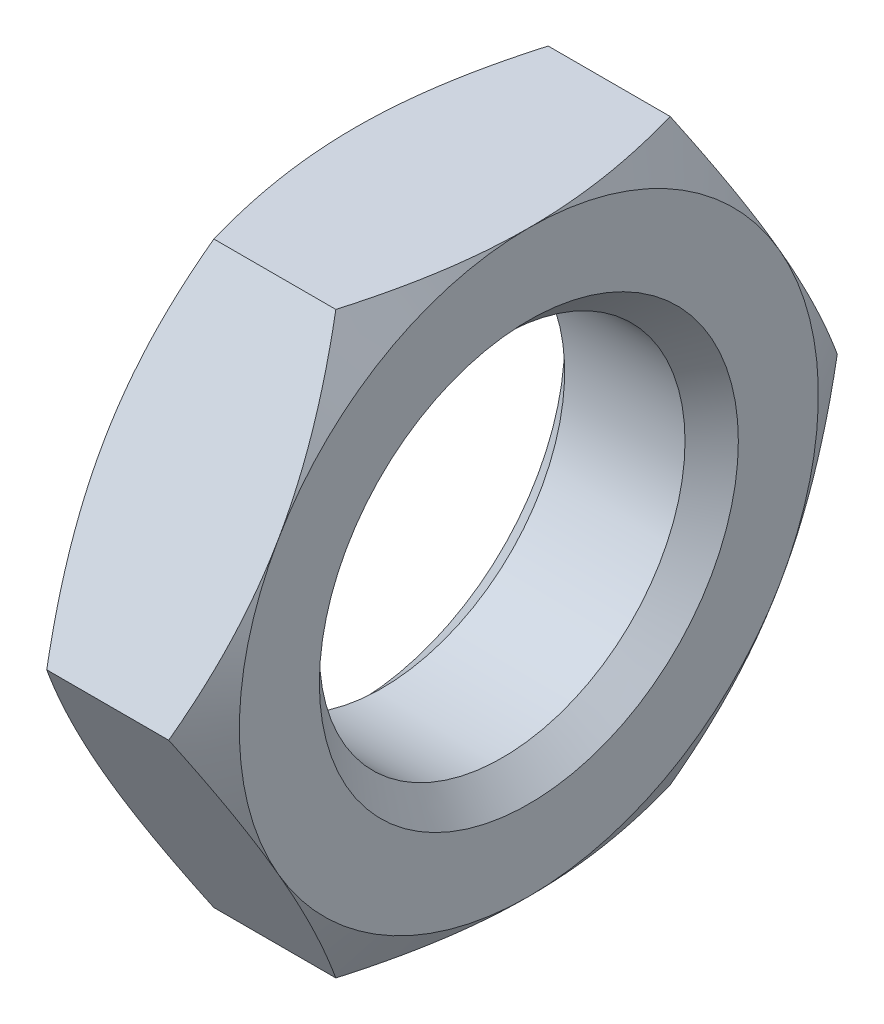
ISO-10303-21;
HEADER;
FILE_DESCRIPTION(('STEP AP214'),'2;1');
FILE_NAME('part.step','',(''),(''),'','','');
FILE_SCHEMA(('AUTOMOTIVE_DESIGN { 1 0 10303 214 1 1 1 1 }'));
ENDSEC;
DATA;
#1=APPLICATION_CONTEXT('core data for automotive mechanical design processes');
#2=APPLICATION_PROTOCOL_DEFINITION('international standard','automotive_design',2000,#1);
#3=PRODUCT_CONTEXT('',#1,'mechanical');
#4=PRODUCT('Part','Part','',(#3));
#5=PRODUCT_RELATED_PRODUCT_CATEGORY('part','',(#4));
#6=PRODUCT_DEFINITION_FORMATION('','',#4);
#7=PRODUCT_DEFINITION_CONTEXT('part definition',#1,'design');
#8=PRODUCT_DEFINITION('design','',#6,#7);
#9=PRODUCT_DEFINITION_SHAPE('','',#8);
#10=(LENGTH_UNIT() NAMED_UNIT(*) SI_UNIT(.MILLI.,.METRE.));
#11=(NAMED_UNIT(*) PLANE_ANGLE_UNIT() SI_UNIT($,.RADIAN.));
#12=(NAMED_UNIT(*) SI_UNIT($,.STERADIAN.) SOLID_ANGLE_UNIT());
#13=UNCERTAINTY_MEASURE_WITH_UNIT(LENGTH_MEASURE(1.E-05),#10,'distance_accuracy_value','');
#14=(GEOMETRIC_REPRESENTATION_CONTEXT(3) GLOBAL_UNCERTAINTY_ASSIGNED_CONTEXT((#13)) GLOBAL_UNIT_ASSIGNED_CONTEXT((#10,
#11,#12)) REPRESENTATION_CONTEXT('',''));
#15=CARTESIAN_POINT('',(0.,0.,0.));
#16=DIRECTION('',(0.,0.,1.));
#17=DIRECTION('',(1.,0.,0.));
#18=AXIS2_PLACEMENT_3D('',#15,#16,#17);
#19=CARTESIAN_POINT('',(5.7,9.5,-5.48482755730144));
#20=DIRECTION('',(1.,0.,0.));
#21=DIRECTION('',(0.,0.,-1.));
#22=AXIS2_PLACEMENT_3D('',#19,#20,#21);
#23=PLANE('',#22);
#24=CARTESIAN_POINT('',(5.7,0.,0.));
#25=DIRECTION('',(1.,0.,0.));
#26=DIRECTION('',(0.,0.,-1.));
#27=AXIS2_PLACEMENT_3D('',#24,#25,#26);
#28=CIRCLE('',#27,6.875);
#29=CARTESIAN_POINT('',(5.7,0.,-6.875));
#30=VERTEX_POINT('',#29);
#31=EDGE_CURVE('E11',#30,#30,#28,.F.);
#32=ORIENTED_EDGE('',*,*,#31,.T.);
#33=EDGE_LOOP('',(#32));
#34=FACE_BOUND('',#33,.T.);
#35=CARTESIAN_POINT('',(5.7,0.,0.));
#36=DIRECTION('',(1.,0.,0.));
#37=DIRECTION('',(0.,0.,-1.));
#38=AXIS2_PLACEMENT_3D('',#35,#36,#37);
#39=CIRCLE('',#38,9.5);
#40=CARTESIAN_POINT('',(5.7,-9.5,0.));
#41=VERTEX_POINT('',#40);
#42=CARTESIAN_POINT('',(5.7,-4.75,-8.22724133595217));
#43=VERTEX_POINT('',#42);
#44=EDGE_CURVE('E142',#41,#43,#39,.T.);
#45=ORIENTED_EDGE('',*,*,#44,.T.);
#46=CARTESIAN_POINT('',(5.7,4.75,-8.22724133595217));
#47=VERTEX_POINT('',#46);
#48=EDGE_CURVE('E130',#43,#47,#39,.T.);
#49=ORIENTED_EDGE('',*,*,#48,.T.);
#50=CARTESIAN_POINT('',(5.7,9.5,0.));
#51=VERTEX_POINT('',#50);
#52=EDGE_CURVE('E144',#47,#51,#39,.T.);
#53=ORIENTED_EDGE('',*,*,#52,.T.);
#54=CARTESIAN_POINT('',(5.7,4.75,8.22724133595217));
#55=VERTEX_POINT('',#54);
#56=EDGE_CURVE('E55',#51,#55,#39,.T.);
#57=ORIENTED_EDGE('',*,*,#56,.T.);
#58=CARTESIAN_POINT('',(5.7,-4.75,8.22724133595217));
#59=VERTEX_POINT('',#58);
#60=EDGE_CURVE('E63',#55,#59,#39,.T.);
#61=ORIENTED_EDGE('',*,*,#60,.T.);
#62=EDGE_CURVE('E166',#59,#41,#39,.T.);
#63=ORIENTED_EDGE('',*,*,#62,.T.);
#64=EDGE_LOOP('',(#45,#49,#53,#57,#61,#63));
#65=FACE_BOUND('',#64,.T.);
#66=ADVANCED_FACE('F39',(#34,#65),#23,.T.);
#67=CARTESIAN_POINT('',(0.,9.5,-5.48482755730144));
#68=DIRECTION('',(1.,0.,0.));
#69=DIRECTION('',(0.,0.,-1.));
#70=AXIS2_PLACEMENT_3D('',#67,#68,#69);
#71=PLANE('',#70);
#72=CARTESIAN_POINT('',(0.,0.,0.));
#73=DIRECTION('',(1.,0.,0.));
#74=DIRECTION('',(0.,0.,-1.));
#75=AXIS2_PLACEMENT_3D('',#72,#73,#74);
#76=CIRCLE('',#75,6.875);
#77=CARTESIAN_POINT('',(0.,0.,6.875));
#78=VERTEX_POINT('',#77);
#79=EDGE_CURVE('E164',#78,#78,#76,.T.);
#80=ORIENTED_EDGE('',*,*,#79,.T.);
#81=EDGE_LOOP('',(#80));
#82=FACE_BOUND('',#81,.T.);
#83=CARTESIAN_POINT('',(0.,0.,0.));
#84=DIRECTION('',(1.,0.,0.));
#85=DIRECTION('',(0.,0.,-1.));
#86=AXIS2_PLACEMENT_3D('',#83,#84,#85);
#87=CIRCLE('',#86,9.5);
#88=CARTESIAN_POINT('',(0.,-4.75,-8.22724133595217));
#89=VERTEX_POINT('',#88);
#90=CARTESIAN_POINT('',(0.,4.75,-8.22724133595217));
#91=VERTEX_POINT('',#90);
#92=EDGE_CURVE('E173',#89,#91,#87,.T.);
#93=ORIENTED_EDGE('',*,*,#92,.F.);
#94=CARTESIAN_POINT('',(0.,-9.5,0.));
#95=VERTEX_POINT('',#94);
#96=EDGE_CURVE('E318',#95,#89,#87,.T.);
#97=ORIENTED_EDGE('',*,*,#96,.F.);
#98=CARTESIAN_POINT('',(0.,-4.75,8.22724133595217));
#99=VERTEX_POINT('',#98);
#100=EDGE_CURVE('E321',#99,#95,#87,.T.);
#101=ORIENTED_EDGE('',*,*,#100,.F.);
#102=CARTESIAN_POINT('',(0.,4.75,8.22724133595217));
#103=VERTEX_POINT('',#102);
#104=EDGE_CURVE('E325',#103,#99,#87,.T.);
#105=ORIENTED_EDGE('',*,*,#104,.F.);
#106=CARTESIAN_POINT('',(0.,9.5,0.));
#107=VERTEX_POINT('',#106);
#108=EDGE_CURVE('E178',#107,#103,#87,.T.);
#109=ORIENTED_EDGE('',*,*,#108,.F.);
#110=EDGE_CURVE('E174',#91,#107,#87,.T.);
#111=ORIENTED_EDGE('',*,*,#110,.F.);
#112=EDGE_LOOP('',(#93,#97,#101,#105,#109,#111));
#113=FACE_BOUND('',#112,.T.);
#114=ADVANCED_FACE('F319',(#82,#113),#71,.F.);
#115=CARTESIAN_POINT('',(5.7,0.,0.));
#116=DIRECTION('',(-1.,0.,0.));
#117=DIRECTION('',(0.,0.,1.));
#118=AXIS2_PLACEMENT_3D('',#115,#116,#117);
#119=CYLINDRICAL_SURFACE('',#118,6.);
#120=CARTESIAN_POINT('',(0.875000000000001,0.,0.));
#121=DIRECTION('',(1.,0.,0.));
#122=DIRECTION('',(0.,0.,-1.));
#123=AXIS2_PLACEMENT_3D('',#120,#121,#122);
#124=CIRCLE('',#123,6.);
#125=CARTESIAN_POINT('',(0.875000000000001,0.,6.));
#126=VERTEX_POINT('',#125);
#127=EDGE_CURVE('E48',#126,#126,#124,.F.);
#128=CARTESIAN_POINT('',(4.825,0.,0.));
#129=DIRECTION('',(1.,0.,0.));
#130=DIRECTION('',(0.,0.,-1.));
#131=AXIS2_PLACEMENT_3D('',#128,#129,#130);
#132=CIRCLE('',#131,6.);
#133=CARTESIAN_POINT('',(4.825,0.,6.));
#134=VERTEX_POINT('',#133);
#135=EDGE_CURVE('E390',#134,#134,#132,.T.);
#136=CARTESIAN_POINT('',(0.875000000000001,0.,6.));
#137=CARTESIAN_POINT('',(0.916145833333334,0.,6.));
#138=CARTESIAN_POINT('',(0.957291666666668,0.,6.));
#139=CARTESIAN_POINT('',(1.03958333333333,0.,6.));
#140=CARTESIAN_POINT('',(1.08072916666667,0.,6.));
#141=CARTESIAN_POINT('',(1.16302083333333,0.,6.));
#142=CARTESIAN_POINT('',(1.20416666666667,0.,6.));
#143=CARTESIAN_POINT('',(1.28645833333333,0.,6.));
#144=CARTESIAN_POINT('',(1.32760416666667,0.,6.));
#145=CARTESIAN_POINT('',(1.40989583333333,0.,6.));
#146=CARTESIAN_POINT('',(1.45104166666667,0.,6.));
#147=CARTESIAN_POINT('',(1.53333333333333,0.,6.));
#148=CARTESIAN_POINT('',(1.57447916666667,0.,6.));
#149=CARTESIAN_POINT('',(1.65677083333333,0.,6.));
#150=CARTESIAN_POINT('',(1.69791666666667,0.,6.));
#151=CARTESIAN_POINT('',(1.78020833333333,0.,6.));
#152=CARTESIAN_POINT('',(1.82135416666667,0.,6.));
#153=CARTESIAN_POINT('',(1.90364583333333,0.,6.));
#154=CARTESIAN_POINT('',(1.94479166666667,0.,6.));
#155=CARTESIAN_POINT('',(2.02708333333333,0.,6.));
#156=CARTESIAN_POINT('',(2.06822916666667,0.,6.));
#157=CARTESIAN_POINT('',(2.15052083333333,0.,6.));
#158=CARTESIAN_POINT('',(2.19166666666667,0.,6.));
#159=CARTESIAN_POINT('',(2.27395833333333,0.,6.));
#160=CARTESIAN_POINT('',(2.31510416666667,0.,6.));
#161=CARTESIAN_POINT('',(2.39739583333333,0.,6.));
#162=CARTESIAN_POINT('',(2.43854166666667,0.,6.));
#163=CARTESIAN_POINT('',(2.52083333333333,0.,6.));
#164=CARTESIAN_POINT('',(2.56197916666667,0.,6.));
#165=CARTESIAN_POINT('',(2.64427083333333,0.,6.));
#166=CARTESIAN_POINT('',(2.68541666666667,0.,6.));
#167=CARTESIAN_POINT('',(2.76770833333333,0.,6.));
#168=CARTESIAN_POINT('',(2.80885416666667,0.,6.));
#169=CARTESIAN_POINT('',(2.89114583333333,0.,6.));
#170=CARTESIAN_POINT('',(2.93229166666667,0.,6.));
#171=CARTESIAN_POINT('',(3.01458333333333,0.,6.));
#172=CARTESIAN_POINT('',(3.05572916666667,0.,6.));
#173=CARTESIAN_POINT('',(3.13802083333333,0.,6.));
#174=CARTESIAN_POINT('',(3.17916666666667,0.,6.));
#175=CARTESIAN_POINT('',(3.26145833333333,0.,6.));
#176=CARTESIAN_POINT('',(3.30260416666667,0.,6.));
#177=CARTESIAN_POINT('',(3.38489583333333,0.,6.));
#178=CARTESIAN_POINT('',(3.42604166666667,0.,6.));
#179=CARTESIAN_POINT('',(3.50833333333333,0.,6.));
#180=CARTESIAN_POINT('',(3.54947916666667,0.,6.));
#181=CARTESIAN_POINT('',(3.63177083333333,0.,6.));
#182=CARTESIAN_POINT('',(3.67291666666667,0.,6.));
#183=CARTESIAN_POINT('',(3.75520833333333,0.,6.));
#184=CARTESIAN_POINT('',(3.79635416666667,0.,6.));
#185=CARTESIAN_POINT('',(3.87864583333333,0.,6.));
#186=CARTESIAN_POINT('',(3.91979166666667,0.,6.));
#187=CARTESIAN_POINT('',(4.00208333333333,0.,6.));
#188=CARTESIAN_POINT('',(4.04322916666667,0.,6.));
#189=CARTESIAN_POINT('',(4.12552083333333,0.,6.));
#190=CARTESIAN_POINT('',(4.16666666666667,0.,6.));
#191=CARTESIAN_POINT('',(4.24895833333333,0.,6.));
#192=CARTESIAN_POINT('',(4.29010416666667,0.,6.));
#193=CARTESIAN_POINT('',(4.37239583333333,0.,6.));
#194=CARTESIAN_POINT('',(4.41354166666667,0.,6.));
#195=CARTESIAN_POINT('',(4.49583333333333,0.,6.));
#196=CARTESIAN_POINT('',(4.53697916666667,0.,6.));
#197=CARTESIAN_POINT('',(4.61927083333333,0.,6.));
#198=CARTESIAN_POINT('',(4.66041666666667,0.,6.));
#199=CARTESIAN_POINT('',(4.74270833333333,0.,6.));
#200=CARTESIAN_POINT('',(4.78385416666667,0.,6.));
#201=CARTESIAN_POINT('',(4.825,0.,6.));
#202=B_SPLINE_CURVE_WITH_KNOTS('',3,(#136,#137,#138,#139,#140,#141,#142,#143,#144,#145,#146,
#147,#148,#149,#150,#151,#152,#153,#154,#155,#156,#157,#158,#159,#160,#161,#162,#163,#164,#165,
#166,#167,#168,#169,#170,#171,#172,#173,#174,#175,#176,#177,#178,#179,#180,#181,#182,#183,#184,
#185,#186,#187,#188,#189,#190,#191,#192,#193,#194,#195,#196,#197,#198,#199,#200,#201),
.UNSPECIFIED.,.F.,.F.,(4,2,2,2,2,2,2,2,2,2,2,2,2,2,2,2,2,2,2,2,2,2,2,2,2,2,2,2,2,2,2,2,4),(0.,
0.1234375,0.246875,0.3703125,0.49375,0.6171875,0.740625,0.8640625,0.9875,1.1109375,1.234375,
1.3578125,1.48125,1.6046875,1.728125,1.8515625,1.975,2.0984375,2.221875,2.3453125,2.46875,
2.5921875,2.715625,2.8390625,2.9625,3.0859375,3.209375,3.3328125,3.45625,3.5796875,3.703125,
3.8265625,3.95),.UNSPECIFIED.);
#203=EDGE_CURVE('BSEAM234',#126,#134,#202,.T.);
#204=ORIENTED_EDGE('',*,*,#127,.T.);
#205=ORIENTED_EDGE('',*,*,#135,.T.);
#206=ORIENTED_EDGE('',*,*,#203,.T.);
#207=ORIENTED_EDGE('',*,*,#203,.F.);
#208=EDGE_LOOP('',(#204,#206,#205,#207));
#209=FACE_BOUND('',#208,.T.);
#210=ADVANCED_FACE('F234',(#209),#119,.F.);
#211=CARTESIAN_POINT('',(0.,0.,0.));
#212=DIRECTION('',(1.,0.,0.));
#213=DIRECTION('',(0.,0.,-1.));
#214=AXIS2_PLACEMENT_3D('',#211,#212,#213);
#215=CONICAL_SURFACE('',#214,9.5,1.0471975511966);
#216=CARTESIAN_POINT('',(0.848572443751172,-9.5002,-5.4847120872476));
#217=CARTESIAN_POINT('',(0.778973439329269,-9.2913692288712,-5.60528058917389));
#218=CARTESIAN_POINT('',(0.712533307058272,-9.08175982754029,-5.72629863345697));
#219=CARTESIAN_POINT('',(0.586847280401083,-8.66086011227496,-5.96930519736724));
#220=CARTESIAN_POINT('',(0.527603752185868,-8.44956926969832,-6.09129402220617));
#221=CARTESIAN_POINT('',(0.361814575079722,-7.81229220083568,-6.45922610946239));
#222=CARTESIAN_POINT('',(0.26751444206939,-7.38379023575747,-6.70662183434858));
#223=CARTESIAN_POINT('',(0.156938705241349,-6.74255666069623,-7.07683821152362));
#224=CARTESIAN_POINT('',(0.125439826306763,-6.53174078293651,-7.19855281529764));
#225=CARTESIAN_POINT('',(0.0726182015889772,-6.10913296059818,-7.44254555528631));
#226=CARTESIAN_POINT('',(0.0512956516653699,-5.89734099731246,-7.56482370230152));
#227=CARTESIAN_POINT('',(0.0193730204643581,-5.47340378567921,-7.80958396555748));
#228=CARTESIAN_POINT('',(0.00876019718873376,-5.26125925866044,-7.93206566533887));
#229=CARTESIAN_POINT('',(-0.00151746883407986,-4.83677424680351,-8.17714220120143));
#230=CARTESIAN_POINT('',(-0.00118264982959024,-4.62443376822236,-8.29973703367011));
#231=CARTESIAN_POINT('',(0.00967336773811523,-4.22745800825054,-8.5289310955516));
#232=CARTESIAN_POINT('',(0.0188702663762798,-4.04279470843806,-8.63554650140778));
#233=CARTESIAN_POINT('',(0.0453653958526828,-3.67389999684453,-8.84852796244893));
#234=CARTESIAN_POINT('',(0.0626641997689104,-3.48966861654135,-8.95489399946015));
#235=CARTESIAN_POINT('',(0.126304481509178,-2.93768832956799,-9.27357996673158));
#236=CARTESIAN_POINT('',(0.184381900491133,-2.57091646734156,-9.48533580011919));
#237=CARTESIAN_POINT('',(0.329576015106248,-1.83348217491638,-9.91109368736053));
#238=CARTESIAN_POINT('',(0.417308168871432,-1.46291385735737,-10.1250414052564));
#239=CARTESIAN_POINT('',(0.616423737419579,-0.727303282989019,-10.5497463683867));
#240=CARTESIAN_POINT('',(0.727760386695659,-0.362251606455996,-10.7605090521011));
#241=CARTESIAN_POINT('',(0.848572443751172,0.000200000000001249,-10.9697705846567));
#242=B_SPLINE_CURVE_WITH_KNOTS('',3,(#216,#217,#218,#219,#220,#221,#222,#223,#224,#225,#226,
#227,#228,#229,#230,#231,#232,#233,#234,#235,#236,#237,#238,#239,#240,#241),.UNSPECIFIED.,.F.,
.F.,(4,2,2,2,2,2,2,2,2,2,2,2,4),(0.,0.752880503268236,1.50600787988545,3.0154687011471,
3.75167336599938,4.48789219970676,5.22323407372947,5.95855322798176,6.59868084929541,
7.23885375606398,8.52010929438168,9.82978009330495,11.1368800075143),.UNSPECIFIED.);
#243=CARTESIAN_POINT('',(0.848505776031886,0.,-10.9696551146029));
#244=VERTEX_POINT('',#243);
#245=EDGE_CURVE('E332',#89,#244,#242,.T.);
#246=ORIENTED_EDGE('',*,*,#245,.F.);
#247=ORIENTED_EDGE('',*,*,#92,.T.);
#248=CARTESIAN_POINT('',(0.848572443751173,-0.000199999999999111,-10.9697705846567));
#249=CARTESIAN_POINT('',(0.778973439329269,0.2086307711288,-10.8492020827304));
#250=CARTESIAN_POINT('',(0.712533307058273,0.418240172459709,-10.7281840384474));
#251=CARTESIAN_POINT('',(0.586847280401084,0.839139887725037,-10.4851774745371));
#252=CARTESIAN_POINT('',(0.527603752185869,1.05043073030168,-10.3631886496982));
#253=CARTESIAN_POINT('',(0.361814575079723,1.68770779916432,-9.99525656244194));
#254=CARTESIAN_POINT('',(0.267514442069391,2.11620976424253,-9.74786083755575));
#255=CARTESIAN_POINT('',(0.156938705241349,2.75744333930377,-9.37764446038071));
#256=CARTESIAN_POINT('',(0.125439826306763,2.96825921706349,-9.25592985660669));
#257=CARTESIAN_POINT('',(0.0726182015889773,3.39086703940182,-9.01193711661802));
#258=CARTESIAN_POINT('',(0.0512956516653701,3.60265900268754,-8.88965896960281));
#259=CARTESIAN_POINT('',(0.0193730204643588,4.02659621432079,-8.64489870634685));
#260=CARTESIAN_POINT('',(0.00876019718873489,4.23874074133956,-8.52241700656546));
#261=CARTESIAN_POINT('',(-0.00151746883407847,4.66322575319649,-8.2773404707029));
#262=CARTESIAN_POINT('',(-0.0011826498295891,4.87556623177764,-8.15474563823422));
#263=CARTESIAN_POINT('',(0.00967336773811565,5.27254199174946,-7.92555157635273));
#264=CARTESIAN_POINT('',(0.0188702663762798,5.45720529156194,-7.81893617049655));
#265=CARTESIAN_POINT('',(0.0453653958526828,5.82610000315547,-7.6059547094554));
#266=CARTESIAN_POINT('',(0.0626641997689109,6.01033138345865,-7.49958867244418));
#267=CARTESIAN_POINT('',(0.126304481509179,6.56231167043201,-7.18090270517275));
#268=CARTESIAN_POINT('',(0.184381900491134,6.92908353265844,-6.96914687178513));
#269=CARTESIAN_POINT('',(0.329576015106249,7.66651782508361,-6.5433889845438));
#270=CARTESIAN_POINT('',(0.417308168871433,8.03708614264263,-6.32944126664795));
#271=CARTESIAN_POINT('',(0.616423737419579,8.77269671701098,-5.90473630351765));
#272=CARTESIAN_POINT('',(0.727760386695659,9.137748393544,-5.69397361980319));
#273=CARTESIAN_POINT('',(0.848572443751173,9.5002,-5.4847120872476));
#274=B_SPLINE_CURVE_WITH_KNOTS('',3,(#248,#249,#250,#251,#252,#253,#254,#255,#256,#257,#258,
#259,#260,#261,#262,#263,#264,#265,#266,#267,#268,#269,#270,#271,#272,#273),.UNSPECIFIED.,.F.,
.F.,(4,2,2,2,2,2,2,2,2,2,2,2,4),(0.,0.752880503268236,1.50600787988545,3.0154687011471,
3.75167336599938,4.48789219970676,5.22323407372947,5.95855322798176,6.59868084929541,
7.23885375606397,8.52010929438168,9.82978009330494,11.1368800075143),.UNSPECIFIED.);
#275=EDGE_CURVE('E215',#244,#91,#274,.T.);
#276=ORIENTED_EDGE('',*,*,#275,.F.);
#277=EDGE_LOOP('',(#246,#247,#276));
#278=FACE_BOUND('',#277,.T.);
#279=ADVANCED_FACE('F194',(#278),#215,.T.);
#280=ORIENTED_EDGE('',*,*,#96,.T.);
#281=CARTESIAN_POINT('',(0.848505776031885,-9.5,-5.48482755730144));
#282=VERTEX_POINT('',#281);
#283=EDGE_CURVE('E156',#282,#89,#242,.T.);
#284=ORIENTED_EDGE('',*,*,#283,.F.);
#285=CARTESIAN_POINT('',(4.68147122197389,-9.5,-14.8260207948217));
#286=CARTESIAN_POINT('',(4.58043564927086,-9.5,-14.6181744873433));
#287=CARTESIAN_POINT('',(4.47989688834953,-9.5,-14.4100867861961));
#288=CARTESIAN_POINT('',(4.27992532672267,-9.5,-13.9933782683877));
#289=CARTESIAN_POINT('',(4.18049253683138,-9.5,-13.784757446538));
#290=CARTESIAN_POINT('',(3.88399601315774,-9.5,-13.1579655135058));
#291=CARTESIAN_POINT('',(3.68876339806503,-9.5,-12.7389249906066));
#292=CARTESIAN_POINT('',(3.30331276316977,-9.5,-11.8958344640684));
#293=CARTESIAN_POINT('',(3.1131270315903,-9.5,-11.4717696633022));
#294=CARTESIAN_POINT('',(2.74041180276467,-9.5,-10.6203004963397));
#295=CARTESIAN_POINT('',(2.55788195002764,-9.5,-10.1928962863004));
#296=CARTESIAN_POINT('',(2.19663711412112,-9.5,-9.31989600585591));
#297=CARTESIAN_POINT('',(2.01824661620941,-9.5,-8.87416493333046));
#298=CARTESIAN_POINT('',(1.67474248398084,-9.5,-7.97752359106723));
#299=CARTESIAN_POINT('',(1.50963032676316,-9.5,-7.52661275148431));
#300=CARTESIAN_POINT('',(1.19695014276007,-9.5,-6.61970337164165));
#301=CARTESIAN_POINT('',(1.04934738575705,-9.5,-6.16371693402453));
#302=CARTESIAN_POINT('',(0.776359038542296,-9.5,-5.24521950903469));
#303=CARTESIAN_POINT('',(0.650966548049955,-9.5,-4.78271059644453));
#304=CARTESIAN_POINT('',(0.429037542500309,-9.5,-3.8534269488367));
#305=CARTESIAN_POINT('',(0.332340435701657,-9.5,-3.38669162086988));
#306=CARTESIAN_POINT('',(0.212951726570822,-9.5,-2.68226463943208));
#307=CARTESIAN_POINT('',(0.17743005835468,-9.5,-2.4467183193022));
#308=CARTESIAN_POINT('',(0.115633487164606,-9.5,-1.97442348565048));
#309=CARTESIAN_POINT('',(0.0893576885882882,-9.5,-1.73767509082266));
#310=CARTESIAN_POINT('',(0.0469107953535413,-9.5,-1.26642652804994));
#311=CARTESIAN_POINT('',(0.0306106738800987,-9.5,-1.0319380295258));
#312=CARTESIAN_POINT('',(0.00794590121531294,-9.5,-0.562481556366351));
#313=CARTESIAN_POINT('',(0.00158108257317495,-9.5,-0.327513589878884));
#314=CARTESIAN_POINT('',(-0.00106091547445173,-9.5,0.142480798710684));
#315=CARTESIAN_POINT('',(0.00266190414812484,-9.5,0.377507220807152));
#316=CARTESIAN_POINT('',(0.0201029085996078,-9.5,0.847191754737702));
#317=CARTESIAN_POINT('',(0.0338215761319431,-9.5,1.08184984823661));
#318=CARTESIAN_POINT('',(0.0782882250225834,-9.5,1.6430154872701));
#319=CARTESIAN_POINT('',(0.113623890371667,-9.5,1.96916744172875));
#320=CARTESIAN_POINT('',(0.201698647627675,-9.5,2.61909605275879));
#321=CARTESIAN_POINT('',(0.254440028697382,-9.5,2.94287239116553));
#322=CARTESIAN_POINT('',(0.435980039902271,-9.5,3.91024350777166));
#323=CARTESIAN_POINT('',(0.588062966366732,-9.5,4.54952905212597));
#324=CARTESIAN_POINT('',(0.852367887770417,-9.5,5.50552869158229));
#325=CARTESIAN_POINT('',(0.947741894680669,-9.5,5.82718654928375));
#326=CARTESIAN_POINT('',(1.14854292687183,-9.5,6.46737969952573));
#327=CARTESIAN_POINT('',(1.25397001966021,-9.5,6.78591497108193));
#328=CARTESIAN_POINT('',(1.47317354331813,-9.5,7.41995994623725));
#329=CARTESIAN_POINT('',(1.58694732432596,-9.5,7.73547057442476));
#330=CARTESIAN_POINT('',(1.82149096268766,-9.5,8.36386821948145));
#331=CARTESIAN_POINT('',(1.94226073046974,-9.5,8.67675526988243));
#332=CARTESIAN_POINT('',(2.23942541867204,-9.5,9.42567064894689));
#333=CARTESIAN_POINT('',(2.41864484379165,-9.5,9.86057627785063));
#334=CARTESIAN_POINT('',(2.7860747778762,-9.5,10.7265846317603));
#335=CARTESIAN_POINT('',(2.97428588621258,-9.5,11.1576871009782));
#336=CARTESIAN_POINT('',(3.35786499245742,-9.5,12.0168133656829));
#337=CARTESIAN_POINT('',(3.55323472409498,-9.5,12.444836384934));
#338=CARTESIAN_POINT('',(3.94965832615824,-9.5,13.2982230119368));
#339=CARTESIAN_POINT('',(4.15071206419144,-9.5,13.7235866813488));
#340=CARTESIAN_POINT('',(4.55765855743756,-9.5,14.572598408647));
#341=CARTESIAN_POINT('',(4.763556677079,-9.5,14.9962438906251));
#342=CARTESIAN_POINT('',(5.17912556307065,-9.5,15.8416801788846));
#343=CARTESIAN_POINT('',(5.38879634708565,-9.5,16.2634709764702));
#344=CARTESIAN_POINT('',(5.81122353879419,-9.5,17.1054287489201));
#345=CARTESIAN_POINT('',(6.02397950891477,-9.5,17.5255959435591));
#346=CARTESIAN_POINT('',(6.45209295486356,-9.5,18.3646036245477));
#347=CARTESIAN_POINT('',(6.66745044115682,-9.5,18.7834441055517));
#348=CARTESIAN_POINT('',(7.27939985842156,-9.5,19.9660156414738));
#349=CARTESIAN_POINT('',(7.67854013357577,-9.5,20.7284279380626));
#350=CARTESIAN_POINT('',(8.48223971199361,-9.5,22.250421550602));
#351=CARTESIAN_POINT('',(8.88679922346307,-9.5,23.0100027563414));
#352=CARTESIAN_POINT('',(9.69898518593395,-9.5,24.5249529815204));
#353=CARTESIAN_POINT('',(10.1066007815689,-9.5,25.2803278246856));
#354=CARTESIAN_POINT('',(10.7204213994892,-9.5,26.4120600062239));
#355=CARTESIAN_POINT('',(10.9254219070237,-9.5,26.7890716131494));
#356=CARTESIAN_POINT('',(11.3361415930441,-9.5,27.5427024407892));
#357=CARTESIAN_POINT('',(11.5418607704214,-9.5,27.9193216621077));
#358=CARTESIAN_POINT('',(11.747897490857,-9.5,28.2957671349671));
#359=B_SPLINE_CURVE_WITH_KNOTS('',3,(#285,#286,#287,#288,#289,#290,#291,#292,#293,#294,#295,
#296,#297,#298,#299,#300,#301,#302,#303,#304,#305,#306,#307,#308,#309,#310,#311,#312,#313,#314,
#315,#316,#317,#318,#319,#320,#321,#322,#323,#324,#325,#326,#327,#328,#329,#330,#331,#332,#333,
#334,#335,#336,#337,#338,#339,#340,#341,#342,#343,#344,#345,#346,#347,#348,#349,#350,#351,#352,
#353,#354,#355,#356,#357,#358),.UNSPECIFIED.,.F.,.F.,(4,2,2,2,2,2,2,2,2,2,2,2,2,2,2,2,2,2,2,2,2,
2,2,2,2,2,2,2,2,2,2,2,2,2,2,2,4),(0.,0.693305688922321,1.38661815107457,2.77344349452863,
4.16766337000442,5.56181843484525,7.00196475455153,8.44227105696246,9.87967094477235,
11.3166234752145,12.7453755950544,13.4598518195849,14.1742588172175,14.8792187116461,
15.584166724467,16.2891146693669,16.9940966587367,17.9777242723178,18.9614813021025,
20.9300488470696,21.9364614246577,22.9428807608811,23.9489819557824,24.9550702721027,
26.3660888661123,27.7772016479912,29.1886584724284,30.6000824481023,32.0131506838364,
33.4262255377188,34.8391018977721,36.2519839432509,38.8336690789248,41.415453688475,
43.9904526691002,45.2778784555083,46.5653022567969),.UNSPECIFIED.);
#360=EDGE_CURVE('E177',#95,#282,#359,.F.);
#361=ORIENTED_EDGE('',*,*,#360,.F.);
#362=EDGE_LOOP('',(#280,#284,#361));
#363=FACE_BOUND('',#362,.T.);
#364=ADVANCED_FACE('F351',(#363),#215,.T.);
#365=CARTESIAN_POINT('',(2.85,0.,0.));
#366=DIRECTION('',(-1.,0.,0.));
#367=DIRECTION('',(0.,0.,1.));
#368=AXIS2_PLACEMENT_3D('',#365,#366,#367);
#369=CONICAL_SURFACE('',#368,14.4363448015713,1.0471975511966);
#370=CARTESIAN_POINT('',(4.85142755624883,0.000200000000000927,-10.9697705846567));
#371=CARTESIAN_POINT('',(4.92102656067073,-0.2086307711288,-10.8492020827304));
#372=CARTESIAN_POINT('',(4.98746669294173,-0.418240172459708,-10.7281840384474));
#373=CARTESIAN_POINT('',(5.11315271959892,-0.839139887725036,-10.4851774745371));
#374=CARTESIAN_POINT('',(5.17239624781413,-1.05043073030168,-10.3631886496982));
#375=CARTESIAN_POINT('',(5.33818542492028,-1.68770779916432,-9.99525656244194));
#376=CARTESIAN_POINT('',(5.43248555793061,-2.11620976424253,-9.74786083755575));
#377=CARTESIAN_POINT('',(5.54306129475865,-2.75744333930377,-9.37764446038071));
#378=CARTESIAN_POINT('',(5.57456017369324,-2.96825921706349,-9.25592985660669));
#379=CARTESIAN_POINT('',(5.62738179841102,-3.39086703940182,-9.01193711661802));
#380=CARTESIAN_POINT('',(5.64870434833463,-3.60265900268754,-8.88965896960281));
#381=CARTESIAN_POINT('',(5.68062697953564,-4.02659621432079,-8.64489870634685));
#382=CARTESIAN_POINT('',(5.69123980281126,-4.23874074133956,-8.52241700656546));
#383=CARTESIAN_POINT('',(5.70151746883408,-4.66322575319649,-8.2773404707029));
#384=CARTESIAN_POINT('',(5.70118264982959,-4.87556623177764,-8.15474563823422));
#385=CARTESIAN_POINT('',(5.69032663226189,-5.27254199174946,-7.92555157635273));
#386=CARTESIAN_POINT('',(5.68112973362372,-5.45720529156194,-7.81893617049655));
#387=CARTESIAN_POINT('',(5.65463460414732,-5.82610000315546,-7.6059547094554));
#388=CARTESIAN_POINT('',(5.63733580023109,-6.01033138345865,-7.49958867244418));
#389=CARTESIAN_POINT('',(5.57369551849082,-6.562311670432,-7.18090270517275));
#390=CARTESIAN_POINT('',(5.51561809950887,-6.92908353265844,-6.96914687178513));
#391=CARTESIAN_POINT('',(5.37042398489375,-7.66651782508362,-6.5433889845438));
#392=CARTESIAN_POINT('',(5.28269183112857,-8.03708614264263,-6.32944126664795));
#393=CARTESIAN_POINT('',(5.08357626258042,-8.77269671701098,-5.90473630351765));
#394=CARTESIAN_POINT('',(4.97223961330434,-9.137748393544,-5.69397361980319));
#395=CARTESIAN_POINT('',(4.85142755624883,-9.5002,-5.4847120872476));
#396=B_SPLINE_CURVE_WITH_KNOTS('',3,(#370,#371,#372,#373,#374,#375,#376,#377,#378,#379,#380,
#381,#382,#383,#384,#385,#386,#387,#388,#389,#390,#391,#392,#393,#394,#395),.UNSPECIFIED.,.F.,
.F.,(4,2,2,2,2,2,2,2,2,2,2,2,4),(0.,0.752880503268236,1.50600787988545,3.0154687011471,
3.75167336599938,4.48789219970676,5.22323407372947,5.95855322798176,6.59868084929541,
7.23885375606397,8.52010929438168,9.82978009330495,11.1368800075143),.UNSPECIFIED.);
#397=CARTESIAN_POINT('',(4.85149422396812,-9.5,-5.48482755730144));
#398=VERTEX_POINT('',#397);
#399=EDGE_CURVE('E147',#43,#398,#396,.T.);
#400=ORIENTED_EDGE('',*,*,#399,.F.);
#401=ORIENTED_EDGE('',*,*,#44,.F.);
#402=CARTESIAN_POINT('',(1.01852877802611,-9.5,-14.8260207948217));
#403=CARTESIAN_POINT('',(1.11956435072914,-9.5,-14.6181744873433));
#404=CARTESIAN_POINT('',(1.22010311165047,-9.5,-14.4100867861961));
#405=CARTESIAN_POINT('',(1.42007467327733,-9.5,-13.9933782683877));
#406=CARTESIAN_POINT('',(1.51950746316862,-9.5,-13.784757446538));
#407=CARTESIAN_POINT('',(1.81600398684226,-9.5,-13.1579655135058));
#408=CARTESIAN_POINT('',(2.01123660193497,-9.5,-12.7389249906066));
#409=CARTESIAN_POINT('',(2.39668723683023,-9.5,-11.8958344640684));
#410=CARTESIAN_POINT('',(2.5868729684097,-9.5,-11.4717696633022));
#411=CARTESIAN_POINT('',(2.95958819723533,-9.5,-10.6203004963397));
#412=CARTESIAN_POINT('',(3.14211804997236,-9.5,-10.1928962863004));
#413=CARTESIAN_POINT('',(3.50336288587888,-9.5,-9.31989600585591));
#414=CARTESIAN_POINT('',(3.68175338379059,-9.5,-8.87416493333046));
#415=CARTESIAN_POINT('',(4.02525751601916,-9.5,-7.97752359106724));
#416=CARTESIAN_POINT('',(4.19036967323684,-9.5,-7.52661275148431));
#417=CARTESIAN_POINT('',(4.50304985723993,-9.5,-6.61970337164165));
#418=CARTESIAN_POINT('',(4.65065261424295,-9.5,-6.16371693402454));
#419=CARTESIAN_POINT('',(4.92364096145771,-9.5,-5.2452195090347));
#420=CARTESIAN_POINT('',(5.04903345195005,-9.5,-4.78271059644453));
#421=CARTESIAN_POINT('',(5.27096245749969,-9.5,-3.8534269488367));
#422=CARTESIAN_POINT('',(5.36765956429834,-9.5,-3.38669162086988));
#423=CARTESIAN_POINT('',(5.48704827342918,-9.5,-2.68226463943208));
#424=CARTESIAN_POINT('',(5.52256994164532,-9.5,-2.4467183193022));
#425=CARTESIAN_POINT('',(5.58436651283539,-9.5,-1.97442348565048));
#426=CARTESIAN_POINT('',(5.61064231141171,-9.5,-1.73767509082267));
#427=CARTESIAN_POINT('',(5.65308920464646,-9.5,-1.26642652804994));
#428=CARTESIAN_POINT('',(5.6693893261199,-9.5,-1.0319380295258));
#429=CARTESIAN_POINT('',(5.69205409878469,-9.5,-0.562481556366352));
#430=CARTESIAN_POINT('',(5.69841891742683,-9.5,-0.327513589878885));
#431=CARTESIAN_POINT('',(5.70106091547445,-9.5,0.142480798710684));
#432=CARTESIAN_POINT('',(5.69733809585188,-9.5,0.377507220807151));
#433=CARTESIAN_POINT('',(5.67989709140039,-9.5,0.847191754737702));
#434=CARTESIAN_POINT('',(5.66617842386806,-9.5,1.08184984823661));
#435=CARTESIAN_POINT('',(5.62171177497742,-9.5,1.6430154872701));
#436=CARTESIAN_POINT('',(5.58637610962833,-9.5,1.96916744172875));
#437=CARTESIAN_POINT('',(5.49830135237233,-9.5,2.61909605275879));
#438=CARTESIAN_POINT('',(5.44555997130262,-9.5,2.94287239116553));
#439=CARTESIAN_POINT('',(5.26401996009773,-9.5,3.91024350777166));
#440=CARTESIAN_POINT('',(5.11193703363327,-9.5,4.54952905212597));
#441=CARTESIAN_POINT('',(4.84763211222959,-9.5,5.50552869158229));
#442=CARTESIAN_POINT('',(4.75225810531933,-9.5,5.82718654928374));
#443=CARTESIAN_POINT('',(4.55145707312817,-9.5,6.46737969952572));
#444=CARTESIAN_POINT('',(4.4460299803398,-9.5,6.78591497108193));
#445=CARTESIAN_POINT('',(4.22682645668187,-9.5,7.41995994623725));
#446=CARTESIAN_POINT('',(4.11305267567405,-9.5,7.73547057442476));
#447=CARTESIAN_POINT('',(3.87850903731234,-9.5,8.36386821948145));
#448=CARTESIAN_POINT('',(3.75773926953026,-9.5,8.67675526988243));
#449=CARTESIAN_POINT('',(3.46057458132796,-9.5,9.42567064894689));
#450=CARTESIAN_POINT('',(3.28135515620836,-9.5,9.86057627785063));
#451=CARTESIAN_POINT('',(2.91392522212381,-9.5,10.7265846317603));
#452=CARTESIAN_POINT('',(2.72571411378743,-9.5,11.1576871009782));
#453=CARTESIAN_POINT('',(2.34213500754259,-9.5,12.0168133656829));
#454=CARTESIAN_POINT('',(2.14676527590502,-9.5,12.444836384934));
#455=CARTESIAN_POINT('',(1.75034167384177,-9.5,13.2982230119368));
#456=CARTESIAN_POINT('',(1.54928793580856,-9.5,13.7235866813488));
#457=CARTESIAN_POINT('',(1.14234144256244,-9.5,14.5725984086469));
#458=CARTESIAN_POINT('',(0.936443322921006,-9.5,14.9962438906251));
#459=CARTESIAN_POINT('',(0.52087443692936,-9.5,15.8416801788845));
#460=CARTESIAN_POINT('',(0.311203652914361,-9.5,16.2634709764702));
#461=CARTESIAN_POINT('',(-0.111223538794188,-9.5,17.10542874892));
#462=CARTESIAN_POINT('',(-0.323979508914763,-9.5,17.5255959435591));
#463=CARTESIAN_POINT('',(-0.752092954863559,-9.5,18.3646036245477));
#464=CARTESIAN_POINT('',(-0.967450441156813,-9.5,18.7834441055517));
#465=CARTESIAN_POINT('',(-1.57939985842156,-9.5,19.9660156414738));
#466=CARTESIAN_POINT('',(-1.97854013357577,-9.5,20.7284279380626));
#467=CARTESIAN_POINT('',(-2.78223971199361,-9.5,22.250421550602));
#468=CARTESIAN_POINT('',(-3.18679922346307,-9.5,23.0100027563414));
#469=CARTESIAN_POINT('',(-3.99898518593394,-9.5,24.5249529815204));
#470=CARTESIAN_POINT('',(-4.4066007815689,-9.5,25.2803278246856));
#471=CARTESIAN_POINT('',(-5.02042139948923,-9.5,26.4120600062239));
#472=CARTESIAN_POINT('',(-5.22542190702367,-9.5,26.7890716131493));
#473=CARTESIAN_POINT('',(-5.63614159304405,-9.5,27.5427024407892));
#474=CARTESIAN_POINT('',(-5.84186077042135,-9.5,27.9193216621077));
#475=CARTESIAN_POINT('',(-6.04789749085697,-9.5,28.2957671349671));
#476=B_SPLINE_CURVE_WITH_KNOTS('',3,(#402,#403,#404,#405,#406,#407,#408,#409,#410,#411,#412,
#413,#414,#415,#416,#417,#418,#419,#420,#421,#422,#423,#424,#425,#426,#427,#428,#429,#430,#431,
#432,#433,#434,#435,#436,#437,#438,#439,#440,#441,#442,#443,#444,#445,#446,#447,#448,#449,#450,
#451,#452,#453,#454,#455,#456,#457,#458,#459,#460,#461,#462,#463,#464,#465,#466,#467,#468,#469,
#470,#471,#472,#473,#474,#475),.UNSPECIFIED.,.F.,.F.,(4,2,2,2,2,2,2,2,2,2,2,2,2,2,2,2,2,2,2,2,2,
2,2,2,2,2,2,2,2,2,2,2,2,2,2,2,4),(0.,0.693305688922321,1.38661815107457,2.77344349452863,
4.16766337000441,5.56181843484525,7.00196475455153,8.44227105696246,9.87967094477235,
11.3166234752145,12.7453755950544,13.4598518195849,14.1742588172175,14.8792187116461,
15.584166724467,16.2891146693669,16.9940966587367,17.9777242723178,18.9614813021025,
20.9300488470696,21.9364614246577,22.9428807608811,23.9489819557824,24.9550702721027,
26.3660888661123,27.7772016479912,29.1886584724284,30.6000824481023,32.0131506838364,
33.4262255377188,34.8391018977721,36.2519839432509,38.8336690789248,41.415453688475,
43.9904526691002,45.2778784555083,46.5653022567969),.UNSPECIFIED.);
#477=EDGE_CURVE('E151',#398,#41,#476,.T.);
#478=ORIENTED_EDGE('',*,*,#477,.F.);
#479=EDGE_LOOP('',(#400,#401,#478));
#480=FACE_BOUND('',#479,.T.);
#481=ADVANCED_FACE('F148',(#480),#369,.T.);
#482=ORIENTED_EDGE('',*,*,#48,.F.);
#483=CARTESIAN_POINT('',(4.85149422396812,0.,-10.9696551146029));
#484=VERTEX_POINT('',#483);
#485=EDGE_CURVE('E134',#484,#43,#396,.T.);
#486=ORIENTED_EDGE('',*,*,#485,.F.);
#487=CARTESIAN_POINT('',(4.85142755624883,9.5002,-5.4847120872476));
#488=CARTESIAN_POINT('',(4.92102656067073,9.2913692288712,-5.60528058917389));
#489=CARTESIAN_POINT('',(4.98746669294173,9.08175982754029,-5.72629863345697));
#490=CARTESIAN_POINT('',(5.11315271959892,8.66086011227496,-5.96930519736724));
#491=CARTESIAN_POINT('',(5.17239624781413,8.44956926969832,-6.09129402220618));
#492=CARTESIAN_POINT('',(5.33818542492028,7.81229220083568,-6.45922610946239));
#493=CARTESIAN_POINT('',(5.43248555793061,7.38379023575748,-6.70662183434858));
#494=CARTESIAN_POINT('',(5.54306129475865,6.74255666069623,-7.07683821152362));
#495=CARTESIAN_POINT('',(5.57456017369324,6.53174078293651,-7.19855281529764));
#496=CARTESIAN_POINT('',(5.62738179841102,6.10913296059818,-7.44254555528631));
#497=CARTESIAN_POINT('',(5.64870434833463,5.89734099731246,-7.56482370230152));
#498=CARTESIAN_POINT('',(5.68062697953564,5.47340378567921,-7.80958396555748));
#499=CARTESIAN_POINT('',(5.69123980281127,5.26125925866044,-7.93206566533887));
#500=CARTESIAN_POINT('',(5.70151746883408,4.83677424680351,-8.17714220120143));
#501=CARTESIAN_POINT('',(5.70118264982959,4.62443376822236,-8.29973703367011));
#502=CARTESIAN_POINT('',(5.69032663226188,4.22745800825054,-8.5289310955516));
#503=CARTESIAN_POINT('',(5.68112973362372,4.04279470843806,-8.63554650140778));
#504=CARTESIAN_POINT('',(5.65463460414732,3.67389999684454,-8.84852796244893));
#505=CARTESIAN_POINT('',(5.63733580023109,3.48966861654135,-8.95489399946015));
#506=CARTESIAN_POINT('',(5.57369551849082,2.937688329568,-9.27357996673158));
#507=CARTESIAN_POINT('',(5.51561809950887,2.57091646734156,-9.4853358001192));
#508=CARTESIAN_POINT('',(5.37042398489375,1.83348217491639,-9.91109368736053));
#509=CARTESIAN_POINT('',(5.28269183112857,1.46291385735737,-10.1250414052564));
#510=CARTESIAN_POINT('',(5.08357626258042,0.727303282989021,-10.5497463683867));
#511=CARTESIAN_POINT('',(4.97223961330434,0.362251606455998,-10.7605090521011));
#512=CARTESIAN_POINT('',(4.85142755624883,-0.00019999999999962,-10.9697705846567));
#513=B_SPLINE_CURVE_WITH_KNOTS('',3,(#487,#488,#489,#490,#491,#492,#493,#494,#495,#496,#497,
#498,#499,#500,#501,#502,#503,#504,#505,#506,#507,#508,#509,#510,#511,#512),.UNSPECIFIED.,.F.,
.F.,(4,2,2,2,2,2,2,2,2,2,2,2,4),(0.,0.752880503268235,1.50600787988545,3.0154687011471,
3.75167336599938,4.48789219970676,5.22323407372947,5.95855322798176,6.59868084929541,
7.23885375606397,8.52010929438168,9.82978009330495,11.1368800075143),.UNSPECIFIED.);
#514=EDGE_CURVE('E136',#47,#484,#513,.T.);
#515=ORIENTED_EDGE('',*,*,#514,.F.);
#516=EDGE_LOOP('',(#482,#486,#515));
#517=FACE_BOUND('',#516,.T.);
#518=ADVANCED_FACE('F132',(#517),#369,.T.);
#519=ORIENTED_EDGE('',*,*,#100,.T.);
#520=CARTESIAN_POINT('',(0.848505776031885,-9.5,5.48482755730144));
#521=VERTEX_POINT('',#520);
#522=EDGE_CURVE('E187',#521,#95,#359,.F.);
#523=ORIENTED_EDGE('',*,*,#522,.F.);
#524=CARTESIAN_POINT('',(0.848572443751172,0.000200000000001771,10.9697705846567));
#525=CARTESIAN_POINT('',(0.778973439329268,-0.208630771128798,10.8492020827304));
#526=CARTESIAN_POINT('',(0.712533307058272,-0.418240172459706,10.7281840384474));
#527=CARTESIAN_POINT('',(0.586847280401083,-0.839139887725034,10.4851774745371));
#528=CARTESIAN_POINT('',(0.527603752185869,-1.05043073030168,10.3631886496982));
#529=CARTESIAN_POINT('',(0.361814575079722,-1.68770779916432,9.99525656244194));
#530=CARTESIAN_POINT('',(0.26751444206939,-2.11620976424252,9.74786083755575));
#531=CARTESIAN_POINT('',(0.156938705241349,-2.75744333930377,9.37764446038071));
#532=CARTESIAN_POINT('',(0.125439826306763,-2.96825921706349,9.25592985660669));
#533=CARTESIAN_POINT('',(0.0726182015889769,-3.39086703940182,9.01193711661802));
#534=CARTESIAN_POINT('',(0.0512956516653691,-3.60265900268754,8.88965896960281));
#535=CARTESIAN_POINT('',(0.0193730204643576,-4.02659621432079,8.64489870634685));
#536=CARTESIAN_POINT('',(0.00876019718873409,-4.23874074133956,8.52241700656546));
#537=CARTESIAN_POINT('',(-0.00151746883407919,-4.66322575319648,8.2773404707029));
#538=CARTESIAN_POINT('',(-0.00118264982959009,-4.87556623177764,8.15474563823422));
#539=CARTESIAN_POINT('',(0.00967336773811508,-5.27254199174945,7.92555157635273));
#540=CARTESIAN_POINT('',(0.0188702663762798,-5.45720529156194,7.81893617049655));
#541=CARTESIAN_POINT('',(0.0453653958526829,-5.82610000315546,7.6059547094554));
#542=CARTESIAN_POINT('',(0.0626641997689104,-6.01033138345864,7.49958867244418));
#543=CARTESIAN_POINT('',(0.126304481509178,-6.562311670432,7.18090270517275));
#544=CARTESIAN_POINT('',(0.184381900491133,-6.92908353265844,6.96914687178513));
#545=CARTESIAN_POINT('',(0.329576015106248,-7.66651782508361,6.5433889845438));
#546=CARTESIAN_POINT('',(0.417308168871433,-8.03708614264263,6.32944126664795));
#547=CARTESIAN_POINT('',(0.616423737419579,-8.77269671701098,5.90473630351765));
#548=CARTESIAN_POINT('',(0.727760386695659,-9.137748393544,5.69397361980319));
#549=CARTESIAN_POINT('',(0.848572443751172,-9.5002,5.4847120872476));
#550=B_SPLINE_CURVE_WITH_KNOTS('',3,(#524,#525,#526,#527,#528,#529,#530,#531,#532,#533,#534,
#535,#536,#537,#538,#539,#540,#541,#542,#543,#544,#545,#546,#547,#548,#549),.UNSPECIFIED.,.F.,
.F.,(4,2,2,2,2,2,2,2,2,2,2,2,4),(0.,0.752880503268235,1.50600787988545,3.0154687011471,
3.75167336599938,4.48789219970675,5.22323407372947,5.95855322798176,6.59868084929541,
7.23885375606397,8.52010929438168,9.82978009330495,11.1368800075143),.UNSPECIFIED.);
#551=EDGE_CURVE('E188',#99,#521,#550,.T.);
#552=ORIENTED_EDGE('',*,*,#551,.F.);
#553=EDGE_LOOP('',(#519,#523,#552));
#554=FACE_BOUND('',#553,.T.);
#555=ADVANCED_FACE('F350',(#554),#215,.T.);
#556=CARTESIAN_POINT('',(4.85149422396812,-9.5,5.48482755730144));
#557=VERTEX_POINT('',#556);
#558=EDGE_CURVE('E216',#41,#557,#476,.T.);
#559=ORIENTED_EDGE('',*,*,#558,.F.);
#560=ORIENTED_EDGE('',*,*,#62,.F.);
#561=CARTESIAN_POINT('',(4.85142755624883,-9.5002,5.4847120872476));
#562=CARTESIAN_POINT('',(4.92102656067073,-9.2913692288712,5.60528058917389));
#563=CARTESIAN_POINT('',(4.98746669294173,-9.08175982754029,5.72629863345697));
#564=CARTESIAN_POINT('',(5.11315271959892,-8.66086011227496,5.96930519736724));
#565=CARTESIAN_POINT('',(5.17239624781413,-8.44956926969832,6.09129402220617));
#566=CARTESIAN_POINT('',(5.33818542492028,-7.81229220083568,6.45922610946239));
#567=CARTESIAN_POINT('',(5.43248555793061,-7.38379023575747,6.70662183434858));
#568=CARTESIAN_POINT('',(5.54306129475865,-6.74255666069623,7.07683821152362));
#569=CARTESIAN_POINT('',(5.57456017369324,-6.53174078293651,7.19855281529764));
#570=CARTESIAN_POINT('',(5.62738179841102,-6.10913296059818,7.44254555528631));
#571=CARTESIAN_POINT('',(5.64870434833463,-5.89734099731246,7.56482370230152));
#572=CARTESIAN_POINT('',(5.68062697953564,-5.47340378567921,7.80958396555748));
#573=CARTESIAN_POINT('',(5.69123980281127,-5.26125925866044,7.93206566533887));
#574=CARTESIAN_POINT('',(5.70151746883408,-4.83677424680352,8.17714220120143));
#575=CARTESIAN_POINT('',(5.70118264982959,-4.62443376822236,8.29973703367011));
#576=CARTESIAN_POINT('',(5.69032663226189,-4.22745800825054,8.5289310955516));
#577=CARTESIAN_POINT('',(5.68112973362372,-4.04279470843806,8.63554650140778));
#578=CARTESIAN_POINT('',(5.65463460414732,-3.67389999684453,8.84852796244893));
#579=CARTESIAN_POINT('',(5.63733580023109,-3.48966861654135,8.95489399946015));
#580=CARTESIAN_POINT('',(5.57369551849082,-2.93768832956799,9.27357996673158));
#581=CARTESIAN_POINT('',(5.51561809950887,-2.57091646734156,9.48533580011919));
#582=CARTESIAN_POINT('',(5.37042398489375,-1.83348217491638,9.91109368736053));
#583=CARTESIAN_POINT('',(5.28269183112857,-1.46291385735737,10.1250414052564));
#584=CARTESIAN_POINT('',(5.08357626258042,-0.727303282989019,10.5497463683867));
#585=CARTESIAN_POINT('',(4.97223961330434,-0.362251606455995,10.7605090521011));
#586=CARTESIAN_POINT('',(4.85142755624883,0.000200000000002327,10.9697705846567));
#587=B_SPLINE_CURVE_WITH_KNOTS('',3,(#561,#562,#563,#564,#565,#566,#567,#568,#569,#570,#571,
#572,#573,#574,#575,#576,#577,#578,#579,#580,#581,#582,#583,#584,#585,#586),.UNSPECIFIED.,.F.,
.F.,(4,2,2,2,2,2,2,2,2,2,2,2,4),(0.,0.752880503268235,1.50600787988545,3.0154687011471,
3.75167336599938,4.48789219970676,5.22323407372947,5.95855322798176,6.59868084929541,
7.23885375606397,8.52010929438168,9.82978009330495,11.1368800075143),.UNSPECIFIED.);
#588=EDGE_CURVE('E247',#557,#59,#587,.T.);
#589=ORIENTED_EDGE('',*,*,#588,.F.);
#590=EDGE_LOOP('',(#559,#560,#589));
#591=FACE_BOUND('',#590,.T.);
#592=ADVANCED_FACE('F431',(#591),#369,.T.);
#593=ORIENTED_EDGE('',*,*,#104,.T.);
#594=CARTESIAN_POINT('',(0.848505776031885,0.,10.9696551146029));
#595=VERTEX_POINT('',#594);
#596=EDGE_CURVE('E288',#595,#99,#550,.T.);
#597=ORIENTED_EDGE('',*,*,#596,.F.);
#598=CARTESIAN_POINT('',(0.848572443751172,9.5002,5.4847120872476));
#599=CARTESIAN_POINT('',(0.778973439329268,9.2913692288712,5.60528058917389));
#600=CARTESIAN_POINT('',(0.712533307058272,9.08175982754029,5.72629863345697));
#601=CARTESIAN_POINT('',(0.586847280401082,8.66086011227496,5.96930519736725));
#602=CARTESIAN_POINT('',(0.527603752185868,8.44956926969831,6.09129402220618));
#603=CARTESIAN_POINT('',(0.361814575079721,7.81229220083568,6.45922610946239));
#604=CARTESIAN_POINT('',(0.267514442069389,7.38379023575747,6.70662183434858));
#605=CARTESIAN_POINT('',(0.156938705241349,6.74255666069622,7.07683821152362));
#606=CARTESIAN_POINT('',(0.125439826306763,6.53174078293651,7.19855281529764));
#607=CARTESIAN_POINT('',(0.0726182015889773,6.10913296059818,7.44254555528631));
#608=CARTESIAN_POINT('',(0.0512956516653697,5.89734099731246,7.56482370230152));
#609=CARTESIAN_POINT('',(0.0193730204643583,5.47340378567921,7.80958396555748));
#610=CARTESIAN_POINT('',(0.00876019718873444,5.26125925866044,7.93206566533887));
#611=CARTESIAN_POINT('',(-0.00151746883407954,4.83677424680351,8.17714220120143));
#612=CARTESIAN_POINT('',(-0.00118264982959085,4.62443376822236,8.29973703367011));
#613=CARTESIAN_POINT('',(0.0096733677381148,4.22745800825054,8.5289310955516));
#614=CARTESIAN_POINT('',(0.0188702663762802,4.04279470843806,8.63554650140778));
#615=CARTESIAN_POINT('',(0.0453653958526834,3.67389999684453,8.84852796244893));
#616=CARTESIAN_POINT('',(0.0626641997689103,3.48966861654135,8.95489399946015));
#617=CARTESIAN_POINT('',(0.126304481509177,2.93768832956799,9.27357996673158));
#618=CARTESIAN_POINT('',(0.184381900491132,2.57091646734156,9.48533580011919));
#619=CARTESIAN_POINT('',(0.329576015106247,1.83348217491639,9.91109368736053));
#620=CARTESIAN_POINT('',(0.417308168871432,1.46291385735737,10.1250414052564));
#621=CARTESIAN_POINT('',(0.616423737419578,0.727303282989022,10.5497463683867));
#622=CARTESIAN_POINT('',(0.727760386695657,0.362251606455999,10.7605090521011));
#623=CARTESIAN_POINT('',(0.848572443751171,-0.000199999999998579,10.9697705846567));
#624=B_SPLINE_CURVE_WITH_KNOTS('',3,(#598,#599,#600,#601,#602,#603,#604,#605,#606,#607,#608,
#609,#610,#611,#612,#613,#614,#615,#616,#617,#618,#619,#620,#621,#622,#623),.UNSPECIFIED.,.F.,
.F.,(4,2,2,2,2,2,2,2,2,2,2,2,4),(0.,0.752880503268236,1.50600787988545,3.0154687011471,
3.75167336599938,4.48789219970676,5.22323407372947,5.95855322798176,6.59868084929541,
7.23885375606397,8.52010929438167,9.82978009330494,11.1368800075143),.UNSPECIFIED.);
#625=EDGE_CURVE('E282',#103,#595,#624,.T.);
#626=ORIENTED_EDGE('',*,*,#625,.F.);
#627=EDGE_LOOP('',(#593,#597,#626));
#628=FACE_BOUND('',#627,.T.);
#629=ADVANCED_FACE('F232',(#628),#215,.T.);
#630=CARTESIAN_POINT('',(4.85149422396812,0.,10.9696551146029));
#631=VERTEX_POINT('',#630);
#632=EDGE_CURVE('E377',#59,#631,#587,.T.);
#633=ORIENTED_EDGE('',*,*,#632,.F.);
#634=ORIENTED_EDGE('',*,*,#60,.F.);
#635=CARTESIAN_POINT('',(4.85142755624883,-0.000199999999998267,10.9697705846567));
#636=CARTESIAN_POINT('',(4.92102656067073,0.208630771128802,10.8492020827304));
#637=CARTESIAN_POINT('',(4.98746669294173,0.41824017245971,10.7281840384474));
#638=CARTESIAN_POINT('',(5.11315271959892,0.839139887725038,10.4851774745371));
#639=CARTESIAN_POINT('',(5.17239624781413,1.05043073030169,10.3631886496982));
#640=CARTESIAN_POINT('',(5.33818542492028,1.68770779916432,9.99525656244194));
#641=CARTESIAN_POINT('',(5.43248555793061,2.11620976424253,9.74786083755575));
#642=CARTESIAN_POINT('',(5.54306129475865,2.75744333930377,9.37764446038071));
#643=CARTESIAN_POINT('',(5.57456017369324,2.96825921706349,9.25592985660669));
#644=CARTESIAN_POINT('',(5.62738179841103,3.39086703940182,9.01193711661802));
#645=CARTESIAN_POINT('',(5.64870434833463,3.60265900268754,8.88965896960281));
#646=CARTESIAN_POINT('',(5.68062697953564,4.02659621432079,8.64489870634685));
#647=CARTESIAN_POINT('',(5.69123980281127,4.23874074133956,8.52241700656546));
#648=CARTESIAN_POINT('',(5.70151746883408,4.66322575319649,8.2773404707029));
#649=CARTESIAN_POINT('',(5.70118264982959,4.87556623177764,8.15474563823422));
#650=CARTESIAN_POINT('',(5.69032663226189,5.27254199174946,7.92555157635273));
#651=CARTESIAN_POINT('',(5.68112973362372,5.45720529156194,7.81893617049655));
#652=CARTESIAN_POINT('',(5.65463460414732,5.82610000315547,7.6059547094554));
#653=CARTESIAN_POINT('',(5.63733580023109,6.01033138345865,7.49958867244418));
#654=CARTESIAN_POINT('',(5.57369551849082,6.56231167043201,7.18090270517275));
#655=CARTESIAN_POINT('',(5.51561809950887,6.92908353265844,6.96914687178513));
#656=CARTESIAN_POINT('',(5.37042398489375,7.66651782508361,6.5433889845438));
#657=CARTESIAN_POINT('',(5.28269183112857,8.03708614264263,6.32944126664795));
#658=CARTESIAN_POINT('',(5.08357626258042,8.77269671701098,5.90473630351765));
#659=CARTESIAN_POINT('',(4.97223961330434,9.137748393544,5.69397361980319));
#660=CARTESIAN_POINT('',(4.85142755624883,9.5002,5.4847120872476));
#661=B_SPLINE_CURVE_WITH_KNOTS('',3,(#635,#636,#637,#638,#639,#640,#641,#642,#643,#644,#645,
#646,#647,#648,#649,#650,#651,#652,#653,#654,#655,#656,#657,#658,#659,#660),.UNSPECIFIED.,.F.,
.F.,(4,2,2,2,2,2,2,2,2,2,2,2,4),(0.,0.752880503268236,1.50600787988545,3.0154687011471,
3.75167336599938,4.48789219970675,5.22323407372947,5.95855322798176,6.59868084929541,
7.23885375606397,8.52010929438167,9.82978009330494,11.1368800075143),.UNSPECIFIED.);
#662=EDGE_CURVE('E372',#631,#55,#661,.T.);
#663=ORIENTED_EDGE('',*,*,#662,.F.);
#664=EDGE_LOOP('',(#633,#634,#663));
#665=FACE_BOUND('',#664,.T.);
#666=ADVANCED_FACE('F227',(#665),#369,.T.);
#667=ORIENTED_EDGE('',*,*,#108,.T.);
#668=CARTESIAN_POINT('',(0.848505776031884,9.5,5.48482755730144));
#669=VERTEX_POINT('',#668);
#670=EDGE_CURVE('E281',#669,#103,#624,.T.);
#671=ORIENTED_EDGE('',*,*,#670,.F.);
#672=CARTESIAN_POINT('',(4.68147122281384,9.5,-14.8260207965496));
#673=CARTESIAN_POINT('',(4.58043565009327,9.5,-14.6181744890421));
#674=CARTESIAN_POINT('',(4.4798968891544,9.5,-14.4100867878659));
#675=CARTESIAN_POINT('',(4.27992532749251,9.5,-13.9933782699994));
#676=CARTESIAN_POINT('',(4.18049253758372,9.5,-13.7847574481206));
#677=CARTESIAN_POINT('',(3.88399601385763,9.5,-13.1579655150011));
#678=CARTESIAN_POINT('',(3.68876339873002,9.5,-12.7389249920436));
#679=CARTESIAN_POINT('',(3.30331276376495,9.5,-11.8958344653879));
#680=CARTESIAN_POINT('',(3.11312703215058,9.5,-11.4717696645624));
#681=CARTESIAN_POINT('',(2.74041180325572,9.5,-10.6203004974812));
#682=CARTESIAN_POINT('',(2.55788195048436,9.5,-10.1928962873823));
#683=CARTESIAN_POINT('',(2.19663711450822,9.5,-9.31989600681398));
#684=CARTESIAN_POINT('',(2.01824661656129,9.5,-8.87416493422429));
#685=CARTESIAN_POINT('',(1.67474248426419,9.5,-7.97752359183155));
#686=CARTESIAN_POINT('',(1.50963032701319,9.5,-7.52661275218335));
#687=CARTESIAN_POINT('',(1.19695014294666,9.5,-6.61970337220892));
#688=CARTESIAN_POINT('',(1.04934738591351,9.5,-6.16371693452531));
#689=CARTESIAN_POINT('',(0.776359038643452,9.5,-5.24521950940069));
#690=CARTESIAN_POINT('',(0.650966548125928,9.5,-4.78271059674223));
#691=CARTESIAN_POINT('',(0.429037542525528,9.5,-3.85342694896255));
#692=CARTESIAN_POINT('',(0.332340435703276,9.5,-3.38669162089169));
#693=CARTESIAN_POINT('',(0.212951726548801,9.5,-2.68226463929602));
#694=CARTESIAN_POINT('',(0.177430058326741,9.5,-2.44671831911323));
#695=CARTESIAN_POINT('',(0.115633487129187,9.5,-1.97442348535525));
#696=CARTESIAN_POINT('',(0.089357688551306,9.5,-1.73767509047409));
#697=CARTESIAN_POINT('',(0.0469107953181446,9.5,-1.26642652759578));
#698=CARTESIAN_POINT('',(0.0306106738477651,9.5,-1.03193802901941));
#699=CARTESIAN_POINT('',(0.00794590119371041,9.5,-0.562481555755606));
#700=CARTESIAN_POINT('',(0.00158108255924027,9.5,-0.327513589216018));
#701=CARTESIAN_POINT('',(-0.001060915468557,9.5,0.142480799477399));
#702=CARTESIAN_POINT('',(0.00266190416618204,9.5,0.377507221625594));
#703=CARTESIAN_POINT('',(0.0201029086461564,9.5,0.84719175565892));
#704=CARTESIAN_POINT('',(0.033821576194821,9.5,1.08184984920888));
#705=CARTESIAN_POINT('',(0.0782882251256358,9.5,1.64301548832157));
#706=CARTESIAN_POINT('',(0.113623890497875,9.5,1.96916744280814));
#707=CARTESIAN_POINT('',(0.201698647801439,9.5,2.61909605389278));
#708=CARTESIAN_POINT('',(0.254440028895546,9.5,2.9428723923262));
#709=CARTESIAN_POINT('',(0.435980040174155,9.5,3.91024350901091));
#710=CARTESIAN_POINT('',(0.58806296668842,9.5,4.54952905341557));
#711=CARTESIAN_POINT('',(0.852367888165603,9.5,5.5055286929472));
#712=CARTESIAN_POINT('',(0.947741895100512,9.5,5.82718655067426));
#713=CARTESIAN_POINT('',(1.14854292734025,9.5,6.46737970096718));
#714=CARTESIAN_POINT('',(1.25397002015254,9.5,6.78591497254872));
#715=CARTESIAN_POINT('',(1.47317354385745,9.5,7.41995994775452));
#716=CARTESIAN_POINT('',(1.58694732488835,9.5,7.73547057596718));
#717=CARTESIAN_POINT('',(1.82149096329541,9.5,8.36386822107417));
#718=CARTESIAN_POINT('',(1.94226073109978,9.5,8.67675527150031));
#719=CARTESIAN_POINT('',(2.23942541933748,9.5,9.42567065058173));
#720=CARTESIAN_POINT('',(2.4186448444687,9.5,9.86057627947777));
#721=CARTESIAN_POINT('',(2.78607477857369,9.5,10.726584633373));
#722=CARTESIAN_POINT('',(2.9742858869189,9.5,11.157687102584));
#723=CARTESIAN_POINT('',(3.35786499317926,9.5,12.0168133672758));
#724=CARTESIAN_POINT('',(3.55323472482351,9.5,12.4448363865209));
#725=CARTESIAN_POINT('',(3.94965832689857,9.5,13.298223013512));
#726=CARTESIAN_POINT('',(4.15071206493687,9.5,13.7235866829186));
#727=CARTESIAN_POINT('',(4.55765855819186,9.5,14.572598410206));
#728=CARTESIAN_POINT('',(4.76355667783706,9.5,14.9962438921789));
#729=CARTESIAN_POINT('',(5.17912556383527,9.5,15.8416801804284));
#730=CARTESIAN_POINT('',(5.38879634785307,9.5,16.2634709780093));
#731=CARTESIAN_POINT('',(5.81122353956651,9.5,17.1054287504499));
#732=CARTESIAN_POINT('',(6.02397950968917,9.5,17.5255959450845));
#733=CARTESIAN_POINT('',(6.45209295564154,9.5,18.3646036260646));
#734=CARTESIAN_POINT('',(6.66745044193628,9.5,18.7834441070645));
#735=CARTESIAN_POINT('',(7.2793998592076,9.5,19.966015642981));
#736=CARTESIAN_POINT('',(7.6785401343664,9.5,20.7284279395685));
#737=CARTESIAN_POINT('',(8.48223971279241,9.5,22.250421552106));
#738=CARTESIAN_POINT('',(8.88679922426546,9.49999999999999,23.0100027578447));
#739=CARTESIAN_POINT('',(9.69898518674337,9.49999999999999,24.5249529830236));
#740=CARTESIAN_POINT('',(10.1066007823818,9.49999999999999,25.2803278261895));
#741=CARTESIAN_POINT('',(10.7204214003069,9.49999999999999,26.412060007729));
#742=CARTESIAN_POINT('',(10.9254219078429,9.49999999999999,26.7890716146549));
#743=CARTESIAN_POINT('',(11.3361415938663,9.49999999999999,27.5427024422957));
#744=CARTESIAN_POINT('',(11.5418607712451,9.49999999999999,27.9193216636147));
#745=CARTESIAN_POINT('',(11.7478974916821,9.49999999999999,28.2957671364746));
#746=B_SPLINE_CURVE_WITH_KNOTS('',3,(#672,#673,#674,#675,#676,#677,#678,#679,#680,#681,#682,
#683,#684,#685,#686,#687,#688,#689,#690,#691,#692,#693,#694,#695,#696,#697,#698,#699,#700,#701,
#702,#703,#704,#705,#706,#707,#708,#709,#710,#711,#712,#713,#714,#715,#716,#717,#718,#719,#720,
#721,#722,#723,#724,#725,#726,#727,#728,#729,#730,#731,#732,#733,#734,#735,#736,#737,#738,#739,
#740,#741,#742,#743,#744,#745),.UNSPECIFIED.,.F.,.F.,(4,2,2,2,2,2,2,2,2,2,2,2,2,2,2,2,2,2,2,2,2,
2,2,2,2,2,2,2,2,2,2,2,2,2,2,2,4),(0.,0.693305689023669,1.38661815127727,2.77344349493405,
4.16766337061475,5.56181843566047,7.0019647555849,8.44227105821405,9.87967094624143,
11.3166234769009,12.74537559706,13.45985182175,14.1742588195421,14.8792187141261,
15.5841667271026,16.2891146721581,16.9940966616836,17.9777242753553,18.9614813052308,
20.9300488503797,21.9364614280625,22.9428807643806,23.9489819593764,24.9550702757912,
26.3660888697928,27.7772016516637,29.1886584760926,30.6000824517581,32.0131506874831,
33.4262255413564,34.8391019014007,36.2519839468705,38.8336690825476,41.4154536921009,
43.9904526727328,45.2778784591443,46.5653022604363),.UNSPECIFIED.);
#747=EDGE_CURVE('E274',#107,#669,#746,.T.);
#748=ORIENTED_EDGE('',*,*,#747,.F.);
#749=EDGE_LOOP('',(#667,#671,#748));
#750=FACE_BOUND('',#749,.T.);
#751=ADVANCED_FACE('F231',(#750),#215,.T.);
#752=ORIENTED_EDGE('',*,*,#56,.F.);
#753=CARTESIAN_POINT('',(1.01852877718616,9.5,-14.8260207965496));
#754=CARTESIAN_POINT('',(1.11956434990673,9.5,-14.6181744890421));
#755=CARTESIAN_POINT('',(1.2201031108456,9.5,-14.4100867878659));
#756=CARTESIAN_POINT('',(1.42007467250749,9.5,-13.9933782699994));
#757=CARTESIAN_POINT('',(1.51950746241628,9.5,-13.7847574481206));
#758=CARTESIAN_POINT('',(1.81600398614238,9.5,-13.1579655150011));
#759=CARTESIAN_POINT('',(2.01123660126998,9.5,-12.7389249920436));
#760=CARTESIAN_POINT('',(2.39668723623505,9.5,-11.8958344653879));
#761=CARTESIAN_POINT('',(2.58687296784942,9.5,-11.4717696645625));
#762=CARTESIAN_POINT('',(2.95958819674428,9.5,-10.6203004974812));
#763=CARTESIAN_POINT('',(3.14211804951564,9.5,-10.1928962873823));
#764=CARTESIAN_POINT('',(3.50336288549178,9.5,-9.31989600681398));
#765=CARTESIAN_POINT('',(3.68175338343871,9.5,-8.8741649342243));
#766=CARTESIAN_POINT('',(4.02525751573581,9.5,-7.97752359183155));
#767=CARTESIAN_POINT('',(4.19036967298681,9.5,-7.52661275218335));
#768=CARTESIAN_POINT('',(4.50304985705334,9.5,-6.61970337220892));
#769=CARTESIAN_POINT('',(4.65065261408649,9.5,-6.16371693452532));
#770=CARTESIAN_POINT('',(4.92364096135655,9.5,-5.24521950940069));
#771=CARTESIAN_POINT('',(5.04903345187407,9.5,-4.78271059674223));
#772=CARTESIAN_POINT('',(5.27096245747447,9.5,-3.85342694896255));
#773=CARTESIAN_POINT('',(5.36765956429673,9.5,-3.38669162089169));
#774=CARTESIAN_POINT('',(5.4870482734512,9.5,-2.68226463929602));
#775=CARTESIAN_POINT('',(5.52256994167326,9.5,-2.44671831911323));
#776=CARTESIAN_POINT('',(5.58436651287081,9.5,-1.97442348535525));
#777=CARTESIAN_POINT('',(5.61064231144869,9.5,-1.73767509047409));
#778=CARTESIAN_POINT('',(5.65308920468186,9.5,-1.26642652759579));
#779=CARTESIAN_POINT('',(5.66938932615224,9.5,-1.03193802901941));
#780=CARTESIAN_POINT('',(5.69205409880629,9.5,-0.562481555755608));
#781=CARTESIAN_POINT('',(5.69841891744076,9.5,-0.327513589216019));
#782=CARTESIAN_POINT('',(5.70106091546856,9.5,0.142480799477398));
#783=CARTESIAN_POINT('',(5.69733809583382,9.5,0.377507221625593));
#784=CARTESIAN_POINT('',(5.67989709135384,9.5,0.847191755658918));
#785=CARTESIAN_POINT('',(5.66617842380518,9.5,1.08184984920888));
#786=CARTESIAN_POINT('',(5.62171177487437,9.5,1.64301548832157));
#787=CARTESIAN_POINT('',(5.58637610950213,9.5,1.96916744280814));
#788=CARTESIAN_POINT('',(5.49830135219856,9.5,2.61909605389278));
#789=CARTESIAN_POINT('',(5.44555997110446,9.5,2.9428723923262));
#790=CARTESIAN_POINT('',(5.26401995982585,9.5,3.91024350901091));
#791=CARTESIAN_POINT('',(5.11193703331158,9.5,4.54952905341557));
#792=CARTESIAN_POINT('',(4.8476321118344,9.5,5.50552869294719));
#793=CARTESIAN_POINT('',(4.75225810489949,9.5,5.82718655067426));
#794=CARTESIAN_POINT('',(4.55145707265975,9.5,6.46737970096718));
#795=CARTESIAN_POINT('',(4.44602997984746,9.5,6.78591497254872));
#796=CARTESIAN_POINT('',(4.22682645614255,9.5,7.41995994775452));
#797=CARTESIAN_POINT('',(4.11305267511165,9.5,7.73547057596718));
#798=CARTESIAN_POINT('',(3.87850903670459,9.5,8.36386822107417));
#799=CARTESIAN_POINT('',(3.75773926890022,9.5,8.67675527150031));
#800=CARTESIAN_POINT('',(3.46057458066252,9.5,9.42567065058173));
#801=CARTESIAN_POINT('',(3.2813551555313,9.5,9.86057627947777));
#802=CARTESIAN_POINT('',(2.91392522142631,9.5,10.726584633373));
#803=CARTESIAN_POINT('',(2.7257141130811,9.5,11.157687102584));
#804=CARTESIAN_POINT('',(2.34213500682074,9.5,12.0168133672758));
#805=CARTESIAN_POINT('',(2.14676527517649,9.5,12.4448363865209));
#806=CARTESIAN_POINT('',(1.75034167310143,9.5,13.298223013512));
#807=CARTESIAN_POINT('',(1.54928793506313,9.5,13.7235866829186));
#808=CARTESIAN_POINT('',(1.14234144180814,9.5,14.572598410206));
#809=CARTESIAN_POINT('',(0.936443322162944,9.5,14.9962438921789));
#810=CARTESIAN_POINT('',(0.520874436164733,9.5,15.8416801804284));
#811=CARTESIAN_POINT('',(0.311203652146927,9.5,16.2634709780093));
#812=CARTESIAN_POINT('',(-0.111223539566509,9.5,17.1054287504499));
#813=CARTESIAN_POINT('',(-0.323979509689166,9.5,17.5255959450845));
#814=CARTESIAN_POINT('',(-0.752092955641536,9.5,18.3646036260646));
#815=CARTESIAN_POINT('',(-0.967450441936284,9.5,18.7834441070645));
#816=CARTESIAN_POINT('',(-1.5793998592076,9.5,19.966015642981));
#817=CARTESIAN_POINT('',(-1.9785401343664,9.5,20.7284279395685));
#818=CARTESIAN_POINT('',(-2.78223971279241,9.5,22.250421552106));
#819=CARTESIAN_POINT('',(-3.18679922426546,9.49999999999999,23.0100027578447));
#820=CARTESIAN_POINT('',(-3.99898518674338,9.49999999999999,24.5249529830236));
#821=CARTESIAN_POINT('',(-4.4066007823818,9.49999999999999,25.2803278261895));
#822=CARTESIAN_POINT('',(-5.02042140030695,9.49999999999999,26.412060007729));
#823=CARTESIAN_POINT('',(-5.22542190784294,9.49999999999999,26.7890716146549));
#824=CARTESIAN_POINT('',(-5.63614159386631,9.49999999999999,27.5427024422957));
#825=CARTESIAN_POINT('',(-5.84186077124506,9.49999999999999,27.9193216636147));
#826=CARTESIAN_POINT('',(-6.04789749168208,9.49999999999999,28.2957671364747));
#827=B_SPLINE_CURVE_WITH_KNOTS('',3,(#753,#754,#755,#756,#757,#758,#759,#760,#761,#762,#763,
#764,#765,#766,#767,#768,#769,#770,#771,#772,#773,#774,#775,#776,#777,#778,#779,#780,#781,#782,
#783,#784,#785,#786,#787,#788,#789,#790,#791,#792,#793,#794,#795,#796,#797,#798,#799,#800,#801,
#802,#803,#804,#805,#806,#807,#808,#809,#810,#811,#812,#813,#814,#815,#816,#817,#818,#819,#820,
#821,#822,#823,#824,#825,#826),.UNSPECIFIED.,.F.,.F.,(4,2,2,2,2,2,2,2,2,2,2,2,2,2,2,2,2,2,2,2,2,
2,2,2,2,2,2,2,2,2,2,2,2,2,2,2,4),(0.,0.693305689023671,1.38661815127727,2.77344349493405,
4.16766337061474,5.56181843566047,7.00196475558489,8.44227105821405,9.87967094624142,
11.3166234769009,12.74537559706,13.45985182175,14.1742588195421,14.8792187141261,
15.5841667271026,16.2891146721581,16.9940966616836,17.9777242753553,18.9614813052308,
20.9300488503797,21.9364614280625,22.9428807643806,23.9489819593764,24.9550702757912,
26.3660888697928,27.7772016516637,29.1886584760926,30.6000824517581,32.0131506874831,
33.4262255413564,34.8391019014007,36.2519839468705,38.8336690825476,41.4154536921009,
43.9904526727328,45.2778784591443,46.5653022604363),.UNSPECIFIED.);
#828=CARTESIAN_POINT('',(4.85149422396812,9.5,5.48482755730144));
#829=VERTEX_POINT('',#828);
#830=EDGE_CURVE('E259',#829,#51,#827,.F.);
#831=ORIENTED_EDGE('',*,*,#830,.F.);
#832=EDGE_CURVE('E260',#55,#829,#661,.T.);
#833=ORIENTED_EDGE('',*,*,#832,.F.);
#834=EDGE_LOOP('',(#752,#831,#833));
#835=FACE_BOUND('',#834,.T.);
#836=ADVANCED_FACE('F233',(#835),#369,.T.);
#837=ORIENTED_EDGE('',*,*,#110,.T.);
#838=CARTESIAN_POINT('',(0.848505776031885,9.5,-5.48482755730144));
#839=VERTEX_POINT('',#838);
#840=EDGE_CURVE('E280',#839,#107,#746,.T.);
#841=ORIENTED_EDGE('',*,*,#840,.F.);
#842=EDGE_CURVE('E217',#91,#839,#274,.T.);
#843=ORIENTED_EDGE('',*,*,#842,.F.);
#844=EDGE_LOOP('',(#837,#841,#843));
#845=FACE_BOUND('',#844,.T.);
#846=ADVANCED_FACE('F335',(#845),#215,.T.);
#847=ORIENTED_EDGE('',*,*,#52,.F.);
#848=CARTESIAN_POINT('',(4.85149422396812,9.5,-5.48482755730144));
#849=VERTEX_POINT('',#848);
#850=EDGE_CURVE('E385',#849,#47,#513,.T.);
#851=ORIENTED_EDGE('',*,*,#850,.F.);
#852=EDGE_CURVE('E252',#51,#849,#827,.F.);
#853=ORIENTED_EDGE('',*,*,#852,.F.);
#854=EDGE_LOOP('',(#847,#851,#853));
#855=FACE_BOUND('',#854,.T.);
#856=ADVANCED_FACE('F387',(#855),#369,.T.);
#857=CARTESIAN_POINT('',(5.7,-9.5,-5.48482755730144));
#858=DIRECTION('',(0.,0.5,0.866025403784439));
#859=DIRECTION('',(0.,-0.866025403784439,0.5));
#860=AXIS2_PLACEMENT_3D('',#857,#858,#859);
#861=PLANE('',#860);
#862=DIRECTION('',(-1.,0.,0.));
#863=VECTOR('',#862,1.);
#864=CARTESIAN_POINT('',(5.7,0.,-10.9696551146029));
#865=LINE('',#864,#863);
#866=EDGE_CURVE('E162',#484,#244,#865,.T.);
#867=ORIENTED_EDGE('',*,*,#866,.F.);
#868=ORIENTED_EDGE('',*,*,#485,.T.);
#869=ORIENTED_EDGE('',*,*,#399,.T.);
#870=DIRECTION('',(-1.,0.,0.));
#871=VECTOR('',#870,1.);
#872=CARTESIAN_POINT('',(5.7,-9.5,-5.48482755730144));
#873=LINE('',#872,#871);
#874=EDGE_CURVE('E370',#398,#282,#873,.T.);
#875=ORIENTED_EDGE('',*,*,#874,.T.);
#876=ORIENTED_EDGE('',*,*,#283,.T.);
#877=ORIENTED_EDGE('',*,*,#245,.T.);
#878=EDGE_LOOP('',(#867,#868,#869,#875,#876,#877));
#879=FACE_BOUND('',#878,.T.);
#880=ADVANCED_FACE('F159',(#879),#861,.F.);
#881=CARTESIAN_POINT('',(5.7,-9.5,5.48482755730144));
#882=DIRECTION('',(0.,1.,0.));
#883=DIRECTION('',(0.,0.,1.));
#884=AXIS2_PLACEMENT_3D('',#881,#882,#883);
#885=PLANE('',#884);
#886=ORIENTED_EDGE('',*,*,#874,.F.);
#887=ORIENTED_EDGE('',*,*,#477,.T.);
#888=ORIENTED_EDGE('',*,*,#558,.T.);
#889=DIRECTION('',(-1.,0.,0.));
#890=VECTOR('',#889,1.);
#891=CARTESIAN_POINT('',(5.7,-9.5,5.48482755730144));
#892=LINE('',#891,#890);
#893=EDGE_CURVE('E313',#557,#521,#892,.T.);
#894=ORIENTED_EDGE('',*,*,#893,.T.);
#895=ORIENTED_EDGE('',*,*,#522,.T.);
#896=ORIENTED_EDGE('',*,*,#360,.T.);
#897=EDGE_LOOP('',(#886,#887,#888,#894,#895,#896));
#898=FACE_BOUND('',#897,.T.);
#899=ADVANCED_FACE('F197',(#898),#885,.F.);
#900=CARTESIAN_POINT('',(5.7,0.,10.9696551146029));
#901=DIRECTION('',(0.,0.5,-0.866025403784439));
#902=DIRECTION('',(0.,0.866025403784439,0.5));
#903=AXIS2_PLACEMENT_3D('',#900,#901,#902);
#904=PLANE('',#903);
#905=ORIENTED_EDGE('',*,*,#893,.F.);
#906=ORIENTED_EDGE('',*,*,#588,.T.);
#907=ORIENTED_EDGE('',*,*,#632,.T.);
#908=DIRECTION('',(-1.,0.,0.));
#909=VECTOR('',#908,1.);
#910=CARTESIAN_POINT('',(5.7,0.,10.9696551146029));
#911=LINE('',#910,#909);
#912=EDGE_CURVE('E366',#631,#595,#911,.T.);
#913=ORIENTED_EDGE('',*,*,#912,.T.);
#914=ORIENTED_EDGE('',*,*,#596,.T.);
#915=ORIENTED_EDGE('',*,*,#551,.T.);
#916=EDGE_LOOP('',(#905,#906,#907,#913,#914,#915));
#917=FACE_BOUND('',#916,.T.);
#918=ADVANCED_FACE('F201',(#917),#904,.F.);
#919=CARTESIAN_POINT('',(5.7,9.5,5.48482755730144));
#920=DIRECTION('',(0.,-0.5,-0.866025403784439));
#921=DIRECTION('',(0.,0.866025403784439,-0.5));
#922=AXIS2_PLACEMENT_3D('',#919,#920,#921);
#923=PLANE('',#922);
#924=ORIENTED_EDGE('',*,*,#912,.F.);
#925=ORIENTED_EDGE('',*,*,#662,.T.);
#926=ORIENTED_EDGE('',*,*,#832,.T.);
#927=DIRECTION('',(-1.,0.,0.));
#928=VECTOR('',#927,1.);
#929=CARTESIAN_POINT('',(5.7,9.5,5.48482755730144));
#930=LINE('',#929,#928);
#931=EDGE_CURVE('E362',#829,#669,#930,.T.);
#932=ORIENTED_EDGE('',*,*,#931,.T.);
#933=ORIENTED_EDGE('',*,*,#670,.T.);
#934=ORIENTED_EDGE('',*,*,#625,.T.);
#935=EDGE_LOOP('',(#924,#925,#926,#932,#933,#934));
#936=FACE_BOUND('',#935,.T.);
#937=ADVANCED_FACE('F269',(#936),#923,.F.);
#938=CARTESIAN_POINT('',(5.7,9.5,-5.48482755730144));
#939=DIRECTION('',(0.,-1.,0.));
#940=DIRECTION('',(0.,0.,-1.));
#941=AXIS2_PLACEMENT_3D('',#938,#939,#940);
#942=PLANE('',#941);
#943=ORIENTED_EDGE('',*,*,#931,.F.);
#944=ORIENTED_EDGE('',*,*,#830,.T.);
#945=ORIENTED_EDGE('',*,*,#852,.T.);
#946=DIRECTION('',(-1.,0.,0.));
#947=VECTOR('',#946,1.);
#948=CARTESIAN_POINT('',(5.7,9.5,-5.48482755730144));
#949=LINE('',#948,#947);
#950=EDGE_CURVE('E355',#849,#839,#949,.T.);
#951=ORIENTED_EDGE('',*,*,#950,.T.);
#952=ORIENTED_EDGE('',*,*,#840,.T.);
#953=ORIENTED_EDGE('',*,*,#747,.T.);
#954=EDGE_LOOP('',(#943,#944,#945,#951,#952,#953));
#955=FACE_BOUND('',#954,.T.);
#956=ADVANCED_FACE('F265',(#955),#942,.F.);
#957=CARTESIAN_POINT('',(5.7,0.,-10.9696551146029));
#958=DIRECTION('',(0.,-0.5,0.866025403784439));
#959=DIRECTION('',(0.,-0.866025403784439,-0.5));
#960=AXIS2_PLACEMENT_3D('',#957,#958,#959);
#961=PLANE('',#960);
#962=ORIENTED_EDGE('',*,*,#950,.F.);
#963=ORIENTED_EDGE('',*,*,#850,.T.);
#964=ORIENTED_EDGE('',*,*,#514,.T.);
#965=ORIENTED_EDGE('',*,*,#866,.T.);
#966=ORIENTED_EDGE('',*,*,#275,.T.);
#967=ORIENTED_EDGE('',*,*,#842,.T.);
#968=EDGE_LOOP('',(#962,#963,#964,#965,#966,#967));
#969=FACE_BOUND('',#968,.T.);
#970=ADVANCED_FACE('F268',(#969),#961,.F.);
#971=CARTESIAN_POINT('',(0.,0.,0.));
#972=DIRECTION('',(-1.,0.,0.));
#973=DIRECTION('',(0.,0.,1.));
#974=AXIS2_PLACEMENT_3D('',#971,#972,#973);
#975=CONICAL_SURFACE('',#974,6.875,0.785398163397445);
#976=CARTESIAN_POINT('',(0.875000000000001,0.,6.));
#977=CARTESIAN_POINT('',(0.865885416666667,0.,6.00911458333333));
#978=CARTESIAN_POINT('',(0.856770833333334,0.,6.01822916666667));
#979=CARTESIAN_POINT('',(0.838541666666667,0.,6.03645833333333));
#980=CARTESIAN_POINT('',(0.829427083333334,0.,6.04557291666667));
#981=CARTESIAN_POINT('',(0.811197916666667,0.,6.06380208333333));
#982=CARTESIAN_POINT('',(0.802083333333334,0.,6.07291666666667));
#983=CARTESIAN_POINT('',(0.783854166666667,0.,6.09114583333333));
#984=CARTESIAN_POINT('',(0.774739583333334,0.,6.10026041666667));
#985=CARTESIAN_POINT('',(0.756510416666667,0.,6.11848958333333));
#986=CARTESIAN_POINT('',(0.747395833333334,0.,6.12760416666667));
#987=CARTESIAN_POINT('',(0.729166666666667,0.,6.14583333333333));
#988=CARTESIAN_POINT('',(0.720052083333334,0.,6.15494791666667));
#989=CARTESIAN_POINT('',(0.701822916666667,0.,6.17317708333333));
#990=CARTESIAN_POINT('',(0.692708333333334,0.,6.18229166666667));
#991=CARTESIAN_POINT('',(0.674479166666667,0.,6.20052083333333));
#992=CARTESIAN_POINT('',(0.665364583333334,0.,6.20963541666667));
#993=CARTESIAN_POINT('',(0.647135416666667,0.,6.22786458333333));
#994=CARTESIAN_POINT('',(0.638020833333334,0.,6.23697916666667));
#995=CARTESIAN_POINT('',(0.619791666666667,0.,6.25520833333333));
#996=CARTESIAN_POINT('',(0.610677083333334,0.,6.26432291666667));
#997=CARTESIAN_POINT('',(0.592447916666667,0.,6.28255208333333));
#998=CARTESIAN_POINT('',(0.583333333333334,0.,6.29166666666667));
#999=CARTESIAN_POINT('',(0.565104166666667,0.,6.30989583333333));
#1000=CARTESIAN_POINT('',(0.555989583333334,0.,6.31901041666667));
#1001=CARTESIAN_POINT('',(0.537760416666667,0.,6.33723958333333));
#1002=CARTESIAN_POINT('',(0.528645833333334,0.,6.34635416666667));
#1003=CARTESIAN_POINT('',(0.510416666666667,0.,6.36458333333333));
#1004=CARTESIAN_POINT('',(0.501302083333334,0.,6.37369791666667));
#1005=CARTESIAN_POINT('',(0.483072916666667,0.,6.39192708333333));
#1006=CARTESIAN_POINT('',(0.473958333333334,0.,6.40104166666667));
#1007=CARTESIAN_POINT('',(0.455729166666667,0.,6.41927083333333));
#1008=CARTESIAN_POINT('',(0.446614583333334,0.,6.42838541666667));
#1009=CARTESIAN_POINT('',(0.428385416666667,0.,6.44661458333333));
#1010=CARTESIAN_POINT('',(0.419270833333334,0.,6.45572916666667));
#1011=CARTESIAN_POINT('',(0.401041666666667,0.,6.47395833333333));
#1012=CARTESIAN_POINT('',(0.391927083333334,0.,6.48307291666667));
#1013=CARTESIAN_POINT('',(0.373697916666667,0.,6.50130208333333));
#1014=CARTESIAN_POINT('',(0.364583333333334,0.,6.51041666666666));
#1015=CARTESIAN_POINT('',(0.346354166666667,0.,6.52864583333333));
#1016=CARTESIAN_POINT('',(0.337239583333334,0.,6.53776041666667));
#1017=CARTESIAN_POINT('',(0.319010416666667,0.,6.55598958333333));
#1018=CARTESIAN_POINT('',(0.309895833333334,0.,6.56510416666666));
#1019=CARTESIAN_POINT('',(0.291666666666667,0.,6.58333333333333));
#1020=CARTESIAN_POINT('',(0.282552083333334,0.,6.59244791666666));
#1021=CARTESIAN_POINT('',(0.264322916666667,0.,6.61067708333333));
#1022=CARTESIAN_POINT('',(0.255208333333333,0.,6.61979166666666));
#1023=CARTESIAN_POINT('',(0.236979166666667,0.,6.63802083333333));
#1024=CARTESIAN_POINT('',(0.227864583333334,0.,6.64713541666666));
#1025=CARTESIAN_POINT('',(0.209635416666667,0.,6.66536458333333));
#1026=CARTESIAN_POINT('',(0.200520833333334,0.,6.67447916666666));
#1027=CARTESIAN_POINT('',(0.182291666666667,0.,6.69270833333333));
#1028=CARTESIAN_POINT('',(0.173177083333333,0.,6.70182291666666));
#1029=CARTESIAN_POINT('',(0.154947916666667,0.,6.72005208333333));
#1030=CARTESIAN_POINT('',(0.145833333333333,0.,6.72916666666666));
#1031=CARTESIAN_POINT('',(0.127604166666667,0.,6.74739583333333));
#1032=CARTESIAN_POINT('',(0.118489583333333,0.,6.75651041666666));
#1033=CARTESIAN_POINT('',(0.100260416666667,0.,6.77473958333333));
#1034=CARTESIAN_POINT('',(0.0911458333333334,0.,6.78385416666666));
#1035=CARTESIAN_POINT('',(0.0729166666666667,0.,6.80208333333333));
#1036=CARTESIAN_POINT('',(0.0638020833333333,0.,6.81119791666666));
#1037=CARTESIAN_POINT('',(0.0455729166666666,0.,6.82942708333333));
#1038=CARTESIAN_POINT('',(0.0364583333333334,0.,6.83854166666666));
#1039=CARTESIAN_POINT('',(0.0182291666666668,0.,6.85677083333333));
#1040=CARTESIAN_POINT('',(0.00911458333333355,0.,6.86588541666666));
#1041=CARTESIAN_POINT('',(0.,0.,6.875));
#1042=B_SPLINE_CURVE_WITH_KNOTS('',3,(#976,#977,#978,#979,#980,#981,#982,#983,#984,#985,#986,
#987,#988,#989,#990,#991,#992,#993,#994,#995,#996,#997,#998,#999,#1000,#1001,#1002,#1003,#1004,
#1005,#1006,#1007,#1008,#1009,#1010,#1011,#1012,#1013,#1014,#1015,#1016,#1017,#1018,#1019,#1020,
#1021,#1022,#1023,#1024,#1025,#1026,#1027,#1028,#1029,#1030,#1031,#1032,#1033,#1034,#1035,#1036,
#1037,#1038,#1039,#1040,#1041),.UNSPECIFIED.,.F.,.F.,(4,2,2,2,2,2,2,2,2,2,2,2,2,2,2,2,2,2,2,2,2,
2,2,2,2,2,2,2,2,2,2,2,4),(0.,0.038669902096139,0.0773398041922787,0.116009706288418,
0.154679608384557,0.193349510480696,0.232019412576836,0.270689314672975,0.309359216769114,
0.348029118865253,0.386699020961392,0.425368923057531,0.464038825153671,0.50270872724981,
0.541378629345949,0.580048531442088,0.618718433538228,0.657388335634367,0.696058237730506,
0.734728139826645,0.773398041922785,0.812067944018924,0.850737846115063,0.889407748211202,
0.928077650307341,0.966747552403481,1.00541745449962,1.04408735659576,1.0827572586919,
1.12142716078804,1.16009706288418,1.19876696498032,1.23743686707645),.UNSPECIFIED.);
#1043=EDGE_CURVE('BSEAM400',#126,#78,#1042,.T.);
#1044=ORIENTED_EDGE('',*,*,#127,.F.);
#1045=ORIENTED_EDGE('',*,*,#79,.F.);
#1046=ORIENTED_EDGE('',*,*,#1043,.T.);
#1047=ORIENTED_EDGE('',*,*,#1043,.F.);
#1048=EDGE_LOOP('',(#1044,#1046,#1045,#1047));
#1049=FACE_BOUND('',#1048,.T.);
#1050=ADVANCED_FACE('F400',(#1049),#975,.F.);
#1051=CARTESIAN_POINT('',(4.825,0.,0.));
#1052=DIRECTION('',(1.,0.,0.));
#1053=DIRECTION('',(0.,0.,-1.));
#1054=AXIS2_PLACEMENT_3D('',#1051,#1052,#1053);
#1055=CONICAL_SURFACE('',#1054,6.,0.78539816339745);
#1056=ORIENTED_EDGE('',*,*,#31,.F.);
#1057=EDGE_LOOP('',(#1056));
#1058=FACE_BOUND('',#1057,.T.);
#1059=ORIENTED_EDGE('',*,*,#135,.F.);
#1060=EDGE_LOOP('',(#1059));
#1061=FACE_BOUND('',#1060,.T.);
#1062=ADVANCED_FACE('F41',(#1058,#1061),#1055,.F.);
#1063=CLOSED_SHELL('',(#66,#114,#210,#279,#364,#481,#518,#555,#592,#629,#666,#751,#836,#846,
#856,#880,#899,#918,#937,#956,#970,#1050,#1062));
#1064=MANIFOLD_SOLID_BREP('B2',#1063);
#1065=ADVANCED_BREP_SHAPE_REPRESENTATION('',(#18,#1064),#14);
#1066=SHAPE_DEFINITION_REPRESENTATION(#9,#1065);
ENDSEC;
END-ISO-10303-21;
